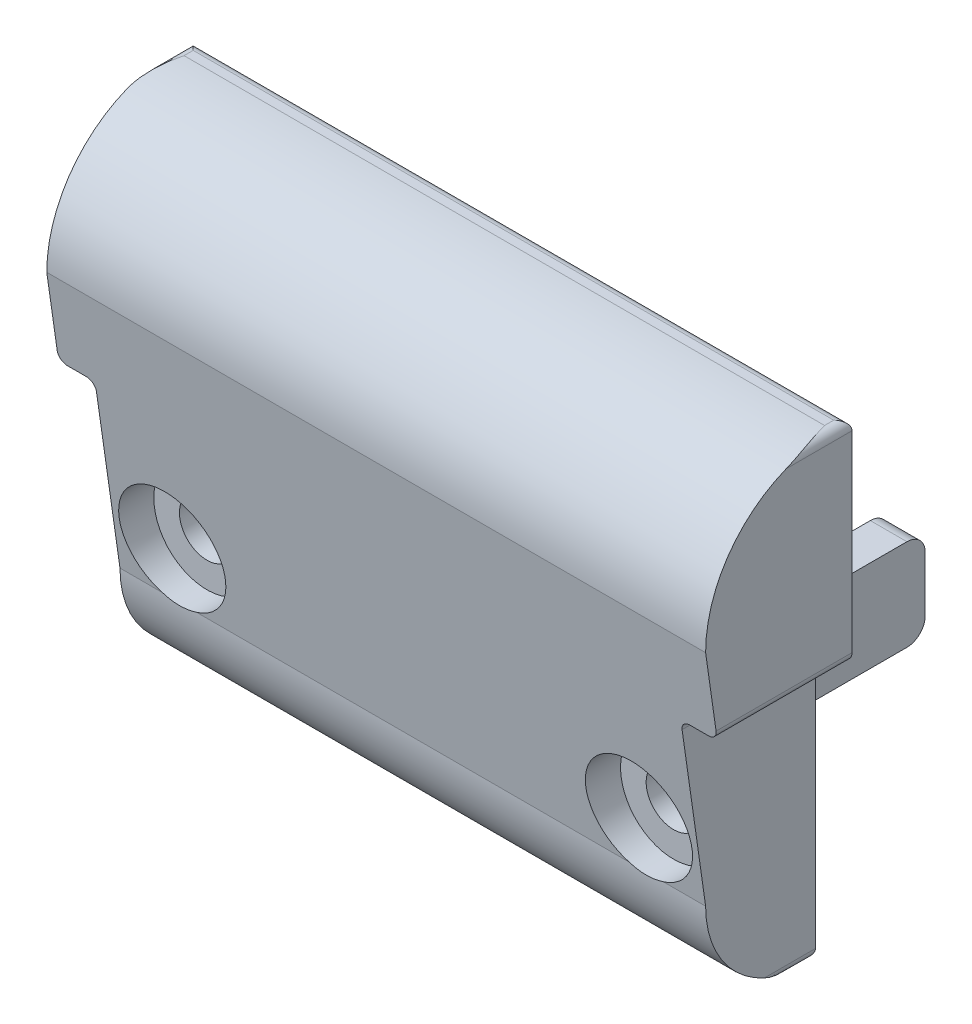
ISO-10303-21;
HEADER;
FILE_DESCRIPTION(('STEP AP214'),'2;1');
FILE_NAME('part.step','',(''),(''),'','','');
FILE_SCHEMA(('AUTOMOTIVE_DESIGN { 1 0 10303 214 1 1 1 1 }'));
ENDSEC;
DATA;
#1=APPLICATION_CONTEXT('core data for automotive mechanical design processes');
#2=APPLICATION_PROTOCOL_DEFINITION('international standard','automotive_design',2000,#1);
#3=PRODUCT_CONTEXT('',#1,'mechanical');
#4=PRODUCT('Part','Part','',(#3));
#5=PRODUCT_RELATED_PRODUCT_CATEGORY('part','',(#4));
#6=PRODUCT_DEFINITION_FORMATION('','',#4);
#7=PRODUCT_DEFINITION_CONTEXT('part definition',#1,'design');
#8=PRODUCT_DEFINITION('design','',#6,#7);
#9=PRODUCT_DEFINITION_SHAPE('','',#8);
#10=(LENGTH_UNIT() NAMED_UNIT(*) SI_UNIT(.MILLI.,.METRE.));
#11=(NAMED_UNIT(*) PLANE_ANGLE_UNIT() SI_UNIT($,.RADIAN.));
#12=(NAMED_UNIT(*) SI_UNIT($,.STERADIAN.) SOLID_ANGLE_UNIT());
#13=UNCERTAINTY_MEASURE_WITH_UNIT(LENGTH_MEASURE(1.E-05),#10,'distance_accuracy_value','');
#14=(GEOMETRIC_REPRESENTATION_CONTEXT(3) GLOBAL_UNCERTAINTY_ASSIGNED_CONTEXT((#13)) GLOBAL_UNIT_ASSIGNED_CONTEXT((#10,
#11,#12)) REPRESENTATION_CONTEXT('',''));
#15=CARTESIAN_POINT('',(0.,0.,0.));
#16=DIRECTION('',(0.,0.,1.));
#17=DIRECTION('',(1.,0.,0.));
#18=AXIS2_PLACEMENT_3D('',#15,#16,#17);
#19=CARTESIAN_POINT('',(-18.,-7.75,0.5));
#20=DIRECTION('',(-1.,0.,0.));
#21=DIRECTION('',(0.,0.,1.));
#22=AXIS2_PLACEMENT_3D('',#19,#20,#21);
#23=CYLINDRICAL_SURFACE('',#22,5.5);
#24=CARTESIAN_POINT('',(-15.4628480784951,-3.97508278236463,4.5));
#25=CARTESIAN_POINT('',(-15.4894617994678,-4.04553324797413,4.56649686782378));
#26=CARTESIAN_POINT('',(-15.5137951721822,-4.11823937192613,4.63158129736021));
#27=CARTESIAN_POINT('',(-15.5571963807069,-4.2680527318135,4.75860105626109));
#28=CARTESIAN_POINT('',(-15.5762557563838,-4.34516680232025,4.8205311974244));
#29=CARTESIAN_POINT('',(-15.6084190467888,-4.50397587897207,4.94109520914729));
#30=CARTESIAN_POINT('',(-15.621483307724,-4.58569748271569,4.99970494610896));
#31=CARTESIAN_POINT('',(-15.6406628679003,-4.75273510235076,5.11265407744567));
#32=CARTESIAN_POINT('',(-15.6467827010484,-4.83804873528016,5.1669962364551));
#33=CARTESIAN_POINT('',(-15.6526433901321,-5.06480654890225,5.30272980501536));
#34=CARTESIAN_POINT('',(-15.6462166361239,-5.20874777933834,5.38040268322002));
#35=CARTESIAN_POINT('',(-15.6102879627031,-5.50023396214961,5.52142261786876));
#36=CARTESIAN_POINT('',(-15.5808584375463,-5.64776620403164,5.58481381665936));
#37=CARTESIAN_POINT('',(-15.4969024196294,-5.94238606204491,5.69687336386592));
#38=CARTESIAN_POINT('',(-15.4422373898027,-6.0894666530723,5.74545795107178));
#39=CARTESIAN_POINT('',(-15.3075856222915,-6.37616882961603,5.82774553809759));
#40=CARTESIAN_POINT('',(-15.2275816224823,-6.51578525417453,5.86143835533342));
#41=CARTESIAN_POINT('',(-15.0512091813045,-6.77105366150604,5.91362633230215));
#42=CARTESIAN_POINT('',(-14.9565922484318,-6.88772453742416,5.9330978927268));
#43=CARTESIAN_POINT('',(-14.7497975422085,-7.10555543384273,5.96322234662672));
#44=CARTESIAN_POINT('',(-14.6376214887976,-7.20671697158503,5.97387610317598));
#45=CARTESIAN_POINT('',(-14.3961926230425,-7.39243162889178,5.98917418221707));
#46=CARTESIAN_POINT('',(-14.2666342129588,-7.47659731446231,5.99368945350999));
#47=CARTESIAN_POINT('',(-13.9957394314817,-7.6233332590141,5.99903288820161));
#48=CARTESIAN_POINT('',(-13.8544003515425,-7.68589853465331,5.99986020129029));
#49=CARTESIAN_POINT('',(-13.5569885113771,-7.79010734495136,6.00011397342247));
#50=CARTESIAN_POINT('',(-13.4005385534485,-7.83067743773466,5.99947542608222));
#51=CARTESIAN_POINT('',(-13.0830758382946,-7.88530915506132,5.99840390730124));
#52=CARTESIAN_POINT('',(-12.9220628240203,-7.89936928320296,5.9979709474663));
#53=CARTESIAN_POINT('',(-12.5979633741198,-7.90059646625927,5.99793832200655));
#54=CARTESIAN_POINT('',(-12.4348755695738,-7.88743389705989,5.99834886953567));
#55=CARTESIAN_POINT('',(-12.1132114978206,-7.83391749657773,5.99942379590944));
#56=CARTESIAN_POINT('',(-11.9546356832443,-7.79356094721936,6.00008820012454));
#57=CARTESIAN_POINT('',(-11.6464591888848,-7.68678204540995,5.99989423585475));
#58=CARTESIAN_POINT('',(-11.496861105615,-7.62035219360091,5.99903542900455));
#59=CARTESIAN_POINT('',(-11.2109968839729,-7.46334164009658,5.99308398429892));
#60=CARTESIAN_POINT('',(-11.0747299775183,-7.37276233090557,5.98799159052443));
#61=CARTESIAN_POINT('',(-10.82095163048,-7.1713428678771,5.97039638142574));
#62=CARTESIAN_POINT('',(-10.7032569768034,-7.06072725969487,5.95797255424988));
#63=CARTESIAN_POINT('',(-10.4885078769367,-6.82245570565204,5.92255605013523));
#64=CARTESIAN_POINT('',(-10.3914466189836,-6.69480540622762,5.89956686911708));
#65=CARTESIAN_POINT('',(-10.2245598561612,-6.43355802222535,5.841726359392));
#66=CARTESIAN_POINT('',(-10.153700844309,-6.30049123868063,5.80745873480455));
#67=CARTESIAN_POINT('',(-10.0345100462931,-6.0286494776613,5.72561543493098));
#68=CARTESIAN_POINT('',(-9.98615903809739,-5.88987948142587,5.67805117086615));
#69=CARTESIAN_POINT('',(-9.91238251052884,-5.61467069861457,5.57067507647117));
#70=CARTESIAN_POINT('',(-9.88649429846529,-5.4782445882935,5.5111431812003));
#71=CARTESIAN_POINT('',(-9.8543142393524,-5.20856970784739,5.37992569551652));
#72=CARTESIAN_POINT('',(-9.84807636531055,-5.07533068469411,5.3082072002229));
#73=CARTESIAN_POINT('',(-9.85217788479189,-4.85671473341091,5.17863195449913));
#74=CARTESIAN_POINT('',(-9.85789787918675,-4.76952925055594,5.12356606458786));
#75=CARTESIAN_POINT('',(-9.87659654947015,-4.59884942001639,5.00897026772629));
#76=CARTESIAN_POINT('',(-9.8895809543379,-4.51535804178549,4.94943686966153));
#77=CARTESIAN_POINT('',(-9.9218753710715,-4.35306298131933,4.82679014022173));
#78=CARTESIAN_POINT('',(-9.94115196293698,-4.2742370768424,4.76369714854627));
#79=CARTESIAN_POINT('',(-9.98521853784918,-4.12119000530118,4.63422185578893));
#80=CARTESIAN_POINT('',(-10.0099986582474,-4.04696090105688,4.56784560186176));
#81=CARTESIAN_POINT('',(-10.0371519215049,-3.97508278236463,4.5));
#82=B_SPLINE_CURVE_WITH_KNOTS('',3,(#24,#25,#26,#27,#28,#29,#30,#31,#32,#33,#34,#35,#36,#37,#38,
#39,#40,#41,#42,#43,#44,#45,#46,#47,#48,#49,#50,#51,#52,#53,#54,#55,#56,#57,#58,#59,#60,#61,#62,
#63,#64,#65,#66,#67,#68,#69,#70,#71,#72,#73,#74,#75,#76,#77,#78,#79,#80,#81),.UNSPECIFIED.,.F.,
.F.,(4,2,2,2,2,2,2,2,2,2,2,2,2,2,2,2,2,2,2,2,2,2,2,2,2,2,2,2,4),(0.,0.301399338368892,
0.603279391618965,0.907128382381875,1.21077888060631,1.69963960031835,2.18696794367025,
2.67700401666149,3.16737464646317,3.61969485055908,4.0719707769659,4.53361518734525,
4.99536603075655,5.4779872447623,5.96063570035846,6.4491624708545,6.93773807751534,
7.42645431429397,7.91514237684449,8.39865908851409,8.88201592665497,9.34350536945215,
9.80459996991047,10.2559546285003,10.7085479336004,11.017983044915,11.3276625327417,
11.6357232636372,11.9432363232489),.UNSPECIFIED.);
#83=CARTESIAN_POINT('',(-13.6705976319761,-7.75,6.));
#84=VERTEX_POINT('',#83);
#85=CARTESIAN_POINT('',(-11.8294023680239,-7.75,6.));
#86=VERTEX_POINT('',#85);
#87=EDGE_CURVE('E28',#84,#86,#82,.T.);
#88=ORIENTED_EDGE('',*,*,#87,.F.);
#89=DIRECTION('',(-1.,0.,0.));
#90=VECTOR('',#89,1.);
#91=CARTESIAN_POINT('',(-18.,-7.75,6.));
#92=LINE('',#91,#90);
#93=CARTESIAN_POINT('',(-16.,-7.75,6.));
#94=VERTEX_POINT('',#93);
#95=EDGE_CURVE('E256',#84,#94,#92,.T.);
#96=ORIENTED_EDGE('',*,*,#95,.T.);
#97=CARTESIAN_POINT('',(-16.,-7.75,0.5));
#98=DIRECTION('',(-1.,0.,0.));
#99=DIRECTION('',(0.,0.,1.));
#100=AXIS2_PLACEMENT_3D('',#97,#98,#99);
#101=CIRCLE('',#100,5.5);
#102=CARTESIAN_POINT('',(-16.,-12.75,2.79128784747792));
#103=VERTEX_POINT('',#102);
#104=EDGE_CURVE('E511',#94,#103,#101,.F.);
#105=ORIENTED_EDGE('',*,*,#104,.T.);
#106=CARTESIAN_POINT('',(-16.,-12.75,2.79128784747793));
#107=CARTESIAN_POINT('',(-15.9999928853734,-12.7676919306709,2.75268234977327));
#108=CARTESIAN_POINT('',(-15.9990619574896,-12.7849301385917,2.71388334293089));
#109=CARTESIAN_POINT('',(-15.9955775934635,-12.8184727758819,2.63597292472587));
#110=CARTESIAN_POINT('',(-15.9930248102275,-12.8347775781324,2.5968616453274));
#111=CARTESIAN_POINT('',(-15.9832822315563,-12.8822128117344,2.4792741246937));
#112=CARTESIAN_POINT('',(-15.9740064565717,-12.9119316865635,2.40039651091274));
#113=CARTESIAN_POINT('',(-15.9512404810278,-12.9674337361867,2.24223625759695));
#114=CARTESIAN_POINT('',(-15.9377660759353,-12.993231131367,2.16295621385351));
#115=CARTESIAN_POINT('',(-15.9075328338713,-13.0410625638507,2.00384917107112));
#116=CARTESIAN_POINT('',(-15.8907720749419,-13.0630943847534,1.92402187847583));
#117=CARTESIAN_POINT('',(-15.8479680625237,-13.110972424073,1.7340321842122));
#118=CARTESIAN_POINT('',(-15.8207989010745,-13.1351583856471,1.62370225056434));
#119=CARTESIAN_POINT('',(-15.7631917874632,-13.1766019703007,1.40258450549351));
#120=CARTESIAN_POINT('',(-15.7327521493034,-13.1938559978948,1.29179648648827));
#121=CARTESIAN_POINT('',(-15.6383560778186,-13.2353694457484,0.959004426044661));
#122=CARTESIAN_POINT('',(-15.571294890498,-13.2494079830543,0.736461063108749));
#123=CARTESIAN_POINT('',(-15.502854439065,-13.2499938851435,0.50946716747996));
#124=CARTESIAN_POINT('',(-15.5014271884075,-13.2499999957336,0.504733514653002));
#125=CARTESIAN_POINT('',(-15.5,-13.25,0.5));
#126=B_SPLINE_CURVE_WITH_KNOTS('',3,(#106,#107,#108,#109,#110,#111,#112,#113,#114,#115,#116,
#117,#118,#119,#120,#121,#122,#123,#124,#125),.UNSPECIFIED.,.F.,.F.,(4,2,2,2,2,2,2,2,2,4),(0.,
0.127365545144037,0.254679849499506,0.508822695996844,0.762020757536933,1.01536734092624,
1.36356786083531,1.71194875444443,2.40835877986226,2.42319118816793),.UNSPECIFIED.);
#127=CARTESIAN_POINT('',(-15.5,-13.25,0.5));
#128=VERTEX_POINT('',#127);
#129=EDGE_CURVE('E307',#103,#128,#126,.T.);
#130=ORIENTED_EDGE('',*,*,#129,.T.);
#131=DIRECTION('',(-1.,0.,0.));
#132=VECTOR('',#131,1.);
#133=CARTESIAN_POINT('',(-36.,-13.25,0.5));
#134=LINE('',#133,#132);
#135=CARTESIAN_POINT('',(15.5,-13.25,0.5));
#136=VERTEX_POINT('',#135);
#137=EDGE_CURVE('E581',#136,#128,#134,.T.);
#138=ORIENTED_EDGE('',*,*,#137,.F.);
#139=CARTESIAN_POINT('',(15.5,-13.25,0.5));
#140=CARTESIAN_POINT('',(15.500000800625,-13.25,0.499999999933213));
#141=CARTESIAN_POINT('',(15.5000016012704,-13.249999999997,0.500000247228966));
#142=CARTESIAN_POINT('',(15.5000031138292,-13.2499999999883,0.500000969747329));
#143=CARTESIAN_POINT('',(15.5000038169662,-13.2499999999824,0.500001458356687));
#144=CARTESIAN_POINT('',(15.5000052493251,-13.2499999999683,0.50000262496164));
#145=CARTESIAN_POINT('',(15.5000059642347,-13.2499999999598,0.500003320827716));
#146=CARTESIAN_POINT('',(15.5000072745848,-13.2499999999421,0.500004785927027));
#147=CARTESIAN_POINT('',(15.500007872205,-13.2499999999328,0.500005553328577));
#148=CARTESIAN_POINT('',(15.5000100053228,-13.2499999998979,0.500008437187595));
#149=CARTESIAN_POINT('',(15.5000114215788,-13.2499999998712,0.500010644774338));
#150=CARTESIAN_POINT('',(15.5000138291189,-13.2499999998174,0.500015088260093));
#151=CARTESIAN_POINT('',(15.5000148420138,-13.2499999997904,0.500017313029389));
#152=CARTESIAN_POINT('',(15.5000189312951,-13.2499999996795,0.500026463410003));
#153=CARTESIAN_POINT('',(15.5000218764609,-13.2499999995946,0.500033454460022));
#154=CARTESIAN_POINT('',(15.5000263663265,-13.2499999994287,0.500046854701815));
#155=CARTESIAN_POINT('',(15.5000280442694,-13.2499999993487,0.500053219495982));
#156=CARTESIAN_POINT('',(15.5000400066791,-13.2499999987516,0.500099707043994));
#157=CARTESIAN_POINT('',(15.5000488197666,-13.2499999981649,0.500140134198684));
#158=CARTESIAN_POINT('',(15.5000873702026,-13.2499999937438,0.500298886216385));
#159=CARTESIAN_POINT('',(15.5001243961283,-13.2499999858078,0.500415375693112));
#160=CARTESIAN_POINT('',(15.5002675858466,-13.2499999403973,0.500874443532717));
#161=CARTESIAN_POINT('',(15.5003688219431,-13.2499998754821,0.501218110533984));
#162=CARTESIAN_POINT('',(15.5007722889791,-13.2499994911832,0.502576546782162));
#163=CARTESIAN_POINT('',(15.5010805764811,-13.2499989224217,0.503589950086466));
#164=CARTESIAN_POINT('',(15.5023580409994,-13.2499953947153,0.507801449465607));
#165=CARTESIAN_POINT('',(15.5033197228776,-13.2499899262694,0.511001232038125));
#166=CARTESIAN_POINT('',(15.5176213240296,-13.2498671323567,0.55857047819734));
#167=CARTESIAN_POINT('',(15.5310199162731,-13.2492158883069,0.602927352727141));
#168=CARTESIAN_POINT('',(15.5571861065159,-13.2468864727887,0.689879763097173));
#169=CARTESIAN_POINT('',(15.5699576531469,-13.2452500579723,0.732475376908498));
#170=CARTESIAN_POINT('',(15.5969873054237,-13.2407174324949,0.822994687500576));
#171=CARTESIAN_POINT('',(15.6112308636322,-13.2376889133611,0.870916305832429));
#172=CARTESIAN_POINT('',(15.6396398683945,-13.2303316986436,0.967250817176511));
#173=CARTESIAN_POINT('',(15.6538027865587,-13.2259892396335,1.01566339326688));
#174=CARTESIAN_POINT('',(15.6879027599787,-13.2138400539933,1.13350277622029));
#175=CARTESIAN_POINT('',(15.7076714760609,-13.205348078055,1.20290954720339));
#176=CARTESIAN_POINT('',(15.745778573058,-13.1859337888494,1.33980964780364));
#177=CARTESIAN_POINT('',(15.7641406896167,-13.1750797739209,1.4073061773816));
#178=CARTESIAN_POINT('',(15.8120031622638,-13.1424045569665,1.5887581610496));
#179=CARTESIAN_POINT('',(15.8404307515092,-13.118188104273,1.70258273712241));
#180=CARTESIAN_POINT('',(15.8926065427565,-13.0620004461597,1.93058529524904));
#181=CARTESIAN_POINT('',(15.9163081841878,-13.0299583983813,2.04475652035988));
#182=CARTESIAN_POINT('',(15.9579604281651,-12.9554940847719,2.28020297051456));
#183=CARTESIAN_POINT('',(15.9753751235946,-12.9124912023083,2.40139887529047));
#184=CARTESIAN_POINT('',(15.9921604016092,-12.8414448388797,2.58118469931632));
#185=CARTESIAN_POINT('',(15.9962004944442,-12.8167255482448,2.64066743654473));
#186=CARTESIAN_POINT('',(16.0004412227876,-12.7651602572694,2.75883010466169));
#187=CARTESIAN_POINT('',(16.0006443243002,-12.7383156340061,2.81751052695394));
#188=CARTESIAN_POINT('',(15.997022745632,-12.6926718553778,2.91281955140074));
#189=CARTESIAN_POINT('',(15.994621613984,-12.6744550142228,2.94978250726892));
#190=CARTESIAN_POINT('',(15.9874956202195,-12.637274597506,3.02314037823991));
#191=CARTESIAN_POINT('',(15.9827694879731,-12.6183106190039,3.05953497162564));
#192=CARTESIAN_POINT('',(15.9706504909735,-12.5800431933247,3.1310270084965));
#193=CARTESIAN_POINT('',(15.9632965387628,-12.560748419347,3.16613554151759));
#194=CARTESIAN_POINT('',(15.9453887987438,-12.521769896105,3.23528489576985));
#195=CARTESIAN_POINT('',(15.9348380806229,-12.5020865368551,3.269326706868));
#196=CARTESIAN_POINT('',(15.9117695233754,-12.4656836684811,3.33079495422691));
#197=CARTESIAN_POINT('',(15.8998051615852,-12.4489747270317,3.35843258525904));
#198=CARTESIAN_POINT('',(15.8724944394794,-12.4157667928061,3.41232267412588));
#199=CARTESIAN_POINT('',(15.8571360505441,-12.3992687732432,3.4385697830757));
#200=CARTESIAN_POINT('',(15.8221938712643,-12.3668981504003,3.48917436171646));
#201=CARTESIAN_POINT('',(15.8025614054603,-12.3510354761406,3.51350525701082));
#202=CARTESIAN_POINT('',(15.7584510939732,-12.3211571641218,3.55863458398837));
#203=CARTESIAN_POINT('',(15.7339971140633,-12.3071329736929,3.5794495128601));
#204=CARTESIAN_POINT('',(15.6920599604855,-12.288070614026,3.60742063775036));
#205=CARTESIAN_POINT('',(15.6764091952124,-12.2818328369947,3.61650237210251));
#206=CARTESIAN_POINT('',(15.643587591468,-12.2707485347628,3.63255919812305));
#207=CARTESIAN_POINT('',(15.6264175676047,-12.2659012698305,3.63953541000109));
#208=CARTESIAN_POINT('',(15.5906552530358,-12.2579433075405,3.65095177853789));
#209=CARTESIAN_POINT('',(15.5720506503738,-12.25485013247,3.65536635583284));
#210=CARTESIAN_POINT('',(15.5341468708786,-12.2508048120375,3.66113418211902));
#211=CARTESIAN_POINT('',(15.5148484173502,-12.2498504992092,3.66249053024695));
#212=CARTESIAN_POINT('',(15.4787386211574,-12.250167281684,3.6620395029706));
#213=CARTESIAN_POINT('',(15.4619185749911,-12.2511745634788,3.66060718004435));
#214=CARTESIAN_POINT('',(15.4288238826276,-12.2548119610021,3.65542058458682));
#215=CARTESIAN_POINT('',(15.4125493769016,-12.2574424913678,3.65166571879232));
#216=CARTESIAN_POINT('',(15.3810571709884,-12.2640884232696,3.64213916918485));
#217=CARTESIAN_POINT('',(15.3658322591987,-12.2680929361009,3.6363833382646));
#218=CARTESIAN_POINT('',(15.3365125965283,-12.2772336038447,3.62317477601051));
#219=CARTESIAN_POINT('',(15.3224182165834,-12.2823701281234,3.61572149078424));
#220=CARTESIAN_POINT('',(15.2870009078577,-12.2970159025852,3.59433366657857));
#221=CARTESIAN_POINT('',(15.2666657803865,-12.3072516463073,3.57925979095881));
#222=CARTESIAN_POINT('',(15.229080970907,-12.3291925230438,3.54653713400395));
#223=CARTESIAN_POINT('',(15.2118413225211,-12.3409022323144,3.52888030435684));
#224=CARTESIAN_POINT('',(15.170162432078,-12.3728145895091,3.48008031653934));
#225=CARTESIAN_POINT('',(15.1480255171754,-12.3937220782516,3.44744614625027));
#226=CARTESIAN_POINT('',(15.1096702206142,-12.4362149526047,3.37941192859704));
#227=CARTESIAN_POINT('',(15.093455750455,-12.4578007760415,3.34401007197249));
#228=CARTESIAN_POINT('',(15.066755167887,-12.4992827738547,3.27413737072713));
#229=CARTESIAN_POINT('',(15.0559305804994,-12.5191842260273,3.23979590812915));
#230=CARTESIAN_POINT('',(15.0375734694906,-12.5586012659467,3.17001232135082));
#231=CARTESIAN_POINT('',(15.0300439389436,-12.5781164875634,3.13456922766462));
#232=CARTESIAN_POINT('',(15.0114195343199,-12.6361543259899,3.02630711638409));
#233=CARTESIAN_POINT('',(15.0045299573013,-12.6737463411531,2.95226401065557));
#234=CARTESIAN_POINT('',(14.9986829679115,-12.7461559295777,2.80121277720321));
#235=CARTESIAN_POINT('',(14.9998536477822,-12.7809197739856,2.72417620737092));
#236=CARTESIAN_POINT('',(15.0083384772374,-12.8468187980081,2.56871459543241));
#237=CARTESIAN_POINT('',(15.0156670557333,-12.8779452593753,2.49028671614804));
#238=CARTESIAN_POINT('',(15.0345466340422,-12.9349577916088,2.33646739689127));
#239=CARTESIAN_POINT('',(15.0458742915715,-12.9610253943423,2.26111439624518));
#240=CARTESIAN_POINT('',(15.0717765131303,-13.0095698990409,2.11032956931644));
#241=CARTESIAN_POINT('',(15.0863315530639,-13.0320670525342,2.03490082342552));
#242=CARTESIAN_POINT('',(15.1235716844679,-13.0809840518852,1.85714029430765));
#243=CARTESIAN_POINT('',(15.1473182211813,-13.106014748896,1.75464603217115));
#244=CARTESIAN_POINT('',(15.1857300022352,-13.1392677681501,1.59940026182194));
#245=CARTESIAN_POINT('',(15.1991659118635,-13.1497284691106,1.54680377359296));
#246=CARTESIAN_POINT('',(15.2268021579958,-13.1691044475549,1.44137487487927));
#247=CARTESIAN_POINT('',(15.2410043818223,-13.1780156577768,1.38854220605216));
#248=CARTESIAN_POINT('',(15.2753042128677,-13.1972441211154,1.26345894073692));
#249=CARTESIAN_POINT('',(15.2956581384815,-13.2068835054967,1.19117400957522));
#250=CARTESIAN_POINT('',(15.3369343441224,-13.223176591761,1.047287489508));
#251=CARTESIAN_POINT('',(15.3578480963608,-13.2298614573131,0.975686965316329));
#252=CARTESIAN_POINT('',(15.3977849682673,-13.2398243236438,0.840437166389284));
#253=CARTESIAN_POINT('',(15.4167578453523,-13.24339979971,0.776794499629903));
#254=CARTESIAN_POINT('',(15.4557490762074,-13.2484399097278,0.646840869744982));
#255=CARTESIAN_POINT('',(15.4757780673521,-13.2498104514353,0.580529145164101));
#256=CARTESIAN_POINT('',(15.4966808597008,-13.2499899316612,0.510999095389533));
#257=CARTESIAN_POINT('',(15.4976432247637,-13.2499954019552,0.507797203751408));
#258=CARTESIAN_POINT('',(15.4989208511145,-13.2499989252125,0.503585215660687));
#259=CARTESIAN_POINT('',(15.4992286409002,-13.2499994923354,0.502573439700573));
#260=CARTESIAN_POINT('',(15.4996315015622,-13.2499998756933,0.501217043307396));
#261=CARTESIAN_POINT('',(15.4997326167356,-13.2499999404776,0.500873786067));
#262=CARTESIAN_POINT('',(15.4998756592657,-13.2499999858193,0.500415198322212));
#263=CARTESIAN_POINT('',(15.4999126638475,-13.2499999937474,0.500298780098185));
#264=CARTESIAN_POINT('',(15.4999511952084,-13.2499999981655,0.500140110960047));
#265=CARTESIAN_POINT('',(15.4999600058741,-13.2499999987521,0.500099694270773));
#266=CARTESIAN_POINT('',(15.4999719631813,-13.2499999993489,0.500053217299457));
#267=CARTESIAN_POINT('',(15.49997364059,-13.2499999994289,0.500046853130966));
#268=CARTESIAN_POINT('',(15.4999781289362,-13.2499999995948,0.500033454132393));
#269=CARTESIAN_POINT('',(15.4999810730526,-13.2499999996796,0.500026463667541));
#270=CARTESIAN_POINT('',(15.4999851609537,-13.2499999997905,0.500017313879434));
#271=CARTESIAN_POINT('',(15.4999861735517,-13.2499999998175,0.500015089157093));
#272=CARTESIAN_POINT('',(15.4999885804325,-13.2499999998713,0.500010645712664));
#273=CARTESIAN_POINT('',(15.4999899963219,-13.249999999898,0.500008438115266));
#274=CARTESIAN_POINT('',(15.4999921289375,-13.2499999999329,0.500005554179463));
#275=CARTESIAN_POINT('',(15.4999927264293,-13.2499999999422,0.500004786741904));
#276=CARTESIAN_POINT('',(15.4999940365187,-13.2499999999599,0.500003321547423));
#277=CARTESIAN_POINT('',(15.4999947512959,-13.2499999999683,0.500002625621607));
#278=CARTESIAN_POINT('',(15.4999961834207,-13.2499999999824,0.500001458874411));
#279=CARTESIAN_POINT('',(15.4999968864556,-13.2499999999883,0.500000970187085));
#280=CARTESIAN_POINT('',(15.4999983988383,-13.249999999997,0.500000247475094));
#281=CARTESIAN_POINT('',(15.499999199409,-13.25,0.500000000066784));
#282=CARTESIAN_POINT('',(15.5,-13.25,0.5));
#283=B_SPLINE_CURVE_WITH_KNOTS('',3,(#139,#140,#141,#142,#143,#144,#145,#146,#147,#148,#149,
#150,#151,#152,#153,#154,#155,#156,#157,#158,#159,#160,#161,#162,#163,#164,#165,#166,#167,#168,
#169,#170,#171,#172,#173,#174,#175,#176,#177,#178,#179,#180,#181,#182,#183,#184,#185,#186,#187,
#188,#189,#190,#191,#192,#193,#194,#195,#196,#197,#198,#199,#200,#201,#202,#203,#204,#205,#206,
#207,#208,#209,#210,#211,#212,#213,#214,#215,#216,#217,#218,#219,#220,#221,#222,#223,#224,#225,
#226,#227,#228,#229,#230,#231,#232,#233,#234,#235,#236,#237,#238,#239,#240,#241,#242,#243,#244,
#245,#246,#247,#248,#249,#250,#251,#252,#253,#254,#255,#256,#257,#258,#259,#260,#261,#262,#263,
#264,#265,#266,#267,#268,#269,#270,#271,#272,#273,#274,#275,#276,#277,#278,#279,#280,#281,#282),
.UNSPECIFIED.,.T.,.F.,(4,2,2,2,2,2,2,2,2,2,2,2,2,2,2,2,2,2,2,2,2,2,2,2,2,2,2,2,2,2,2,2,2,2,2,2,
2,2,2,2,2,2,2,2,2,2,2,2,2,2,2,2,2,2,2,2,2,2,2,2,2,2,2,2,2,2,2,2,2,2,2,4),(0.,
2.40967791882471E-06,4.97127419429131E-06,7.94892544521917E-06,1.08645080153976E-05,
1.87003870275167E-05,2.60278699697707E-05,4.87353255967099E-05,6.8456371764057E-05,
0.000192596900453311,0.000558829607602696,0.0016340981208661,0.00481130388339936,
0.0148354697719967,0.153837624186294,0.287326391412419,0.437564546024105,0.589434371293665,
0.80737013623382,1.01968748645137,1.37874189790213,1.74117572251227,2.12966375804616,
2.32317333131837,2.51655853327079,2.64033158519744,2.76417232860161,2.88625046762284,
3.00821175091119,3.11138351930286,3.21492697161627,3.31971783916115,3.42400247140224,
3.4812389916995,3.53844500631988,3.59621283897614,3.65392210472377,3.7044017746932,
3.75489434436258,3.80499566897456,3.85511336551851,3.93655475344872,4.01825553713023,
4.15140335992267,4.2846389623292,4.40787968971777,4.53123213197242,4.78049003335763,
5.03371813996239,5.28754125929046,5.52898626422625,5.76900866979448,6.09316443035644,
6.25899635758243,6.42525721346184,6.65232957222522,6.87694606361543,7.07643356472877,
7.2842275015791,7.29425831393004,7.29743041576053,7.29850440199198,7.29887041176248,
7.298994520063,7.29901423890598,7.29903694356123,7.29904427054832,7.29905210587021,
7.29905502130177,7.29905799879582,7.29906056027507,7.29906296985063),.UNSPECIFIED.);
#284=CARTESIAN_POINT('',(16.,-12.75,2.79128784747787));
#285=VERTEX_POINT('',#284);
#286=EDGE_CURVE('E298',#136,#285,#283,.T.);
#287=ORIENTED_EDGE('',*,*,#286,.T.);
#288=CARTESIAN_POINT('',(16.,-7.75,0.5));
#289=DIRECTION('',(-1.,0.,0.));
#290=DIRECTION('',(0.,0.,1.));
#291=AXIS2_PLACEMENT_3D('',#288,#289,#290);
#292=CIRCLE('',#291,5.5);
#293=CARTESIAN_POINT('',(16.,-7.75,6.));
#294=VERTEX_POINT('',#293);
#295=EDGE_CURVE('E588',#285,#294,#292,.T.);
#296=ORIENTED_EDGE('',*,*,#295,.T.);
#297=CARTESIAN_POINT('',(13.6705976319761,-7.75,6.));
#298=VERTEX_POINT('',#297);
#299=EDGE_CURVE('E269',#294,#298,#92,.T.);
#300=ORIENTED_EDGE('',*,*,#299,.T.);
#301=CARTESIAN_POINT('',(10.0371519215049,-3.97508278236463,4.5));
#302=CARTESIAN_POINT('',(10.0105382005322,-4.04553324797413,4.56649686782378));
#303=CARTESIAN_POINT('',(9.98620482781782,-4.11823937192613,4.63158129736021));
#304=CARTESIAN_POINT('',(9.94280361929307,-4.2680527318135,4.75860105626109));
#305=CARTESIAN_POINT('',(9.92374424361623,-4.34516680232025,4.82053119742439));
#306=CARTESIAN_POINT('',(9.89158095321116,-4.50397587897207,4.94109520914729));
#307=CARTESIAN_POINT('',(9.87851669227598,-4.58569748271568,4.99970494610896));
#308=CARTESIAN_POINT('',(9.85933713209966,-4.75273510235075,5.11265407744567));
#309=CARTESIAN_POINT('',(9.85321729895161,-4.83804873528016,5.1669962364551));
#310=CARTESIAN_POINT('',(9.84735660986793,-5.06480654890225,5.30272980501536));
#311=CARTESIAN_POINT('',(9.85378336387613,-5.20874777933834,5.38040268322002));
#312=CARTESIAN_POINT('',(9.88971203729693,-5.50023396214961,5.52142261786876));
#313=CARTESIAN_POINT('',(9.91914156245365,-5.64776620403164,5.58481381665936));
#314=CARTESIAN_POINT('',(10.0030975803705,-5.94238606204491,5.69687336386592));
#315=CARTESIAN_POINT('',(10.0577626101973,-6.0894666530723,5.74545795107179));
#316=CARTESIAN_POINT('',(10.1924143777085,-6.37616882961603,5.82774553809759));
#317=CARTESIAN_POINT('',(10.2724183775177,-6.51578525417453,5.86143835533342));
#318=CARTESIAN_POINT('',(10.4487908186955,-6.77105366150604,5.91362633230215));
#319=CARTESIAN_POINT('',(10.5434077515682,-6.88772453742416,5.9330978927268));
#320=CARTESIAN_POINT('',(10.7502024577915,-7.10555543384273,5.96322234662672));
#321=CARTESIAN_POINT('',(10.8623785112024,-7.20671697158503,5.97387610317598));
#322=CARTESIAN_POINT('',(11.1038073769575,-7.39243162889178,5.98917418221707));
#323=CARTESIAN_POINT('',(11.2333657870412,-7.47659731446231,5.99368945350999));
#324=CARTESIAN_POINT('',(11.5042605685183,-7.62333325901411,5.99903288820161));
#325=CARTESIAN_POINT('',(11.6455996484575,-7.68589853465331,5.99986020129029));
#326=CARTESIAN_POINT('',(11.9430114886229,-7.79010734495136,6.00011397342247));
#327=CARTESIAN_POINT('',(12.0994614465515,-7.83067743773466,5.99947542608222));
#328=CARTESIAN_POINT('',(12.4169241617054,-7.88530915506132,5.99840390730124));
#329=CARTESIAN_POINT('',(12.5779371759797,-7.89936928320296,5.9979709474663));
#330=CARTESIAN_POINT('',(12.9020366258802,-7.90059646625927,5.99793832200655));
#331=CARTESIAN_POINT('',(13.0651244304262,-7.88743389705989,5.99834886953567));
#332=CARTESIAN_POINT('',(13.3867885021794,-7.83391749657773,5.99942379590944));
#333=CARTESIAN_POINT('',(13.5453643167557,-7.79356094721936,6.00008820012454));
#334=CARTESIAN_POINT('',(13.8535408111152,-7.68678204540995,5.99989423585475));
#335=CARTESIAN_POINT('',(14.003138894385,-7.62035219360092,5.99903542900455));
#336=CARTESIAN_POINT('',(14.2890031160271,-7.46334164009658,5.99308398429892));
#337=CARTESIAN_POINT('',(14.4252700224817,-7.37276233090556,5.98799159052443));
#338=CARTESIAN_POINT('',(14.67904836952,-7.1713428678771,5.97039638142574));
#339=CARTESIAN_POINT('',(14.7967430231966,-7.06072725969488,5.95797255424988));
#340=CARTESIAN_POINT('',(15.0114921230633,-6.82245570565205,5.92255605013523));
#341=CARTESIAN_POINT('',(15.1085533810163,-6.69480540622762,5.89956686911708));
#342=CARTESIAN_POINT('',(15.2754401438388,-6.43355802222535,5.841726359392));
#343=CARTESIAN_POINT('',(15.346299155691,-6.30049123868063,5.80745873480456));
#344=CARTESIAN_POINT('',(15.4654899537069,-6.0286494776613,5.72561543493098));
#345=CARTESIAN_POINT('',(15.5138409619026,-5.88987948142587,5.67805117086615));
#346=CARTESIAN_POINT('',(15.5876174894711,-5.61467069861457,5.57067507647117));
#347=CARTESIAN_POINT('',(15.6135057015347,-5.4782445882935,5.5111431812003));
#348=CARTESIAN_POINT('',(15.6456857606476,-5.20856970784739,5.37992569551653));
#349=CARTESIAN_POINT('',(15.6519236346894,-5.07533068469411,5.3082072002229));
#350=CARTESIAN_POINT('',(15.6478221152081,-4.85671473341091,5.17863195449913));
#351=CARTESIAN_POINT('',(15.6421021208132,-4.76952925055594,5.12356606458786));
#352=CARTESIAN_POINT('',(15.6234034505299,-4.59884942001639,5.00897026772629));
#353=CARTESIAN_POINT('',(15.6104190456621,-4.51535804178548,4.94943686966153));
#354=CARTESIAN_POINT('',(15.5781246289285,-4.35306298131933,4.82679014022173));
#355=CARTESIAN_POINT('',(15.558848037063,-4.2742370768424,4.76369714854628));
#356=CARTESIAN_POINT('',(15.5147814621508,-4.12119000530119,4.63422185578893));
#357=CARTESIAN_POINT('',(15.4900013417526,-4.04696090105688,4.56784560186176));
#358=CARTESIAN_POINT('',(15.4628480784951,-3.97508278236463,4.5));
#359=B_SPLINE_CURVE_WITH_KNOTS('',3,(#301,#302,#303,#304,#305,#306,#307,#308,#309,#310,#311,
#312,#313,#314,#315,#316,#317,#318,#319,#320,#321,#322,#323,#324,#325,#326,#327,#328,#329,#330,
#331,#332,#333,#334,#335,#336,#337,#338,#339,#340,#341,#342,#343,#344,#345,#346,#347,#348,#349,
#350,#351,#352,#353,#354,#355,#356,#357,#358),.UNSPECIFIED.,.F.,.F.,(4,2,2,2,2,2,2,2,2,2,2,2,2,
2,2,2,2,2,2,2,2,2,2,2,2,2,2,2,4),(0.,0.301399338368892,0.603279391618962,0.907128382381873,
1.21077888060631,1.69963960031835,2.18696794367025,2.67700401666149,3.16737464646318,
3.61969485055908,4.0719707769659,4.53361518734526,4.99536603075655,5.4779872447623,
5.96063570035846,6.4491624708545,6.93773807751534,7.42645431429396,7.91514237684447,
8.39865908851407,8.88201592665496,9.34350536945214,9.80459996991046,10.2559546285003,
10.7085479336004,11.017983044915,11.3276625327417,11.6357232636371,11.9432363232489),.UNSPECIFIED.);
#360=CARTESIAN_POINT('',(11.8294023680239,-7.75,6.));
#361=VERTEX_POINT('',#360);
#362=EDGE_CURVE('E34',#361,#298,#359,.T.);
#363=ORIENTED_EDGE('',*,*,#362,.F.);
#364=EDGE_CURVE('E258',#361,#86,#92,.T.);
#365=ORIENTED_EDGE('',*,*,#364,.T.);
#366=EDGE_LOOP('',(#88,#96,#105,#130,#138,#287,#296,#300,#363,#365));
#367=FACE_BOUND('',#366,.T.);
#368=ADVANCED_FACE('F14',(#367),#23,.T.);
#369=CARTESIAN_POINT('',(-18.,-7.75,6.));
#370=DIRECTION('',(0.,0.14142135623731,-0.989949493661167));
#371=DIRECTION('',(0.,-0.989949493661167,-0.14142135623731));
#372=AXIS2_PLACEMENT_3D('',#369,#370,#371);
#373=PLANE('',#372);
#374=ORIENTED_EDGE('',*,*,#95,.F.);
#375=CARTESIAN_POINT('',(-12.75,-5.,6.39285714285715));
#376=DIRECTION('',(0.,0.14142135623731,-0.989949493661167));
#377=DIRECTION('',(0.,-0.989949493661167,-0.14142135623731));
#378=AXIS2_PLACEMENT_3D('',#375,#376,#377);
#379=ELLIPSE('',#378,2.92944237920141,2.9);
#380=EDGE_CURVE('E9',#84,#86,#379,.T.);
#381=ORIENTED_EDGE('',*,*,#380,.T.);
#382=ORIENTED_EDGE('',*,*,#364,.F.);
#383=CARTESIAN_POINT('',(12.75,-5.,6.39285714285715));
#384=DIRECTION('',(0.,0.14142135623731,-0.989949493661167));
#385=DIRECTION('',(0.,-0.989949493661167,-0.14142135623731));
#386=AXIS2_PLACEMENT_3D('',#383,#384,#385);
#387=ELLIPSE('',#386,2.92944237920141,2.9);
#388=EDGE_CURVE('E22',#361,#298,#387,.T.);
#389=ORIENTED_EDGE('',*,*,#388,.T.);
#390=ORIENTED_EDGE('',*,*,#299,.F.);
#391=DIRECTION('',(0.,0.989949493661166,0.14142135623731));
#392=VECTOR('',#391,1.);
#393=CARTESIAN_POINT('',(16.,-7.75,6.));
#394=LINE('',#393,#392);
#395=CARTESIAN_POINT('',(16.,1.25,7.28571428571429));
#396=VERTEX_POINT('',#395);
#397=EDGE_CURVE('E585',#294,#396,#394,.T.);
#398=ORIENTED_EDGE('',*,*,#397,.T.);
#399=CARTESIAN_POINT('',(16.5,1.25,7.28571428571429));
#400=DIRECTION('',(0.,0.14142135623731,-0.989949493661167));
#401=DIRECTION('',(0.,-0.989949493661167,-0.14142135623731));
#402=AXIS2_PLACEMENT_3D('',#399,#400,#401);
#403=ELLIPSE('',#402,0.50507627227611,0.5);
#404=CARTESIAN_POINT('',(16.5,1.75,7.35714285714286));
#405=VERTEX_POINT('',#404);
#406=EDGE_CURVE('E267',#405,#396,#403,.F.);
#407=ORIENTED_EDGE('',*,*,#406,.F.);
#408=DIRECTION('',(-1.,0.,0.));
#409=VECTOR('',#408,1.);
#410=CARTESIAN_POINT('',(17.5,1.75,7.35714285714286));
#411=LINE('',#410,#409);
#412=CARTESIAN_POINT('',(17.5,1.75,7.35714285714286));
#413=VERTEX_POINT('',#412);
#414=EDGE_CURVE('E745',#405,#413,#411,.F.);
#415=ORIENTED_EDGE('',*,*,#414,.T.);
#416=CARTESIAN_POINT('',(17.5,2.25,7.42857142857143));
#417=DIRECTION('',(0.,0.14142135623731,-0.989949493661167));
#418=DIRECTION('',(0.,-0.989949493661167,-0.14142135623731));
#419=AXIS2_PLACEMENT_3D('',#416,#417,#418);
#420=ELLIPSE('',#419,0.50507627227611,0.5);
#421=CARTESIAN_POINT('',(18.,2.25,7.42857142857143));
#422=VERTEX_POINT('',#421);
#423=EDGE_CURVE('E270',#422,#413,#420,.T.);
#424=ORIENTED_EDGE('',*,*,#423,.F.);
#425=DIRECTION('',(0.,0.989949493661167,0.141421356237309));
#426=VECTOR('',#425,1.);
#427=CARTESIAN_POINT('',(18.,2.25,7.42857142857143));
#428=LINE('',#427,#426);
#429=CARTESIAN_POINT('',(18.,6.25,8.));
#430=VERTEX_POINT('',#429);
#431=EDGE_CURVE('E561',#422,#430,#428,.T.);
#432=ORIENTED_EDGE('',*,*,#431,.T.);
#433=DIRECTION('',(-1.,0.,0.));
#434=VECTOR('',#433,1.);
#435=CARTESIAN_POINT('',(-18.,6.25,8.));
#436=LINE('',#435,#434);
#437=CARTESIAN_POINT('',(-18.,6.25,8.));
#438=VERTEX_POINT('',#437);
#439=EDGE_CURVE('E282',#438,#430,#436,.F.);
#440=ORIENTED_EDGE('',*,*,#439,.F.);
#441=DIRECTION('',(0.,-0.989949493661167,-0.141421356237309));
#442=VECTOR('',#441,1.);
#443=CARTESIAN_POINT('',(-18.,6.25,8.));
#444=LINE('',#443,#442);
#445=CARTESIAN_POINT('',(-18.,2.25,7.42857142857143));
#446=VERTEX_POINT('',#445);
#447=EDGE_CURVE('E569',#438,#446,#444,.T.);
#448=ORIENTED_EDGE('',*,*,#447,.T.);
#449=CARTESIAN_POINT('',(-17.5,2.25,7.42857142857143));
#450=DIRECTION('',(0.,0.14142135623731,-0.989949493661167));
#451=DIRECTION('',(0.,-0.989949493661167,-0.14142135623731));
#452=AXIS2_PLACEMENT_3D('',#449,#450,#451);
#453=ELLIPSE('',#452,0.505076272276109,0.5);
#454=CARTESIAN_POINT('',(-17.5,1.75,7.35714285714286));
#455=VERTEX_POINT('',#454);
#456=EDGE_CURVE('E278',#455,#446,#453,.T.);
#457=ORIENTED_EDGE('',*,*,#456,.F.);
#458=DIRECTION('',(-1.,0.,0.));
#459=VECTOR('',#458,1.);
#460=CARTESIAN_POINT('',(-16.5,1.75,7.35714285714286));
#461=LINE('',#460,#459);
#462=CARTESIAN_POINT('',(-16.5,1.75,7.35714285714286));
#463=VERTEX_POINT('',#462);
#464=EDGE_CURVE('E673',#455,#463,#461,.F.);
#465=ORIENTED_EDGE('',*,*,#464,.T.);
#466=CARTESIAN_POINT('',(-16.5,1.25,7.28571428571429));
#467=DIRECTION('',(0.,0.14142135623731,-0.989949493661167));
#468=DIRECTION('',(0.,-0.989949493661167,-0.14142135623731));
#469=AXIS2_PLACEMENT_3D('',#466,#467,#468);
#470=ELLIPSE('',#469,0.50507627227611,0.5);
#471=CARTESIAN_POINT('',(-16.,1.25,7.28571428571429));
#472=VERTEX_POINT('',#471);
#473=EDGE_CURVE('E275',#472,#463,#470,.F.);
#474=ORIENTED_EDGE('',*,*,#473,.F.);
#475=DIRECTION('',(0.,-0.989949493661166,-0.14142135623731));
#476=VECTOR('',#475,1.);
#477=CARTESIAN_POINT('',(-16.,1.25,7.28571428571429));
#478=LINE('',#477,#476);
#479=EDGE_CURVE('E265',#472,#94,#478,.T.);
#480=ORIENTED_EDGE('',*,*,#479,.T.);
#481=EDGE_LOOP('',(#374,#381,#382,#389,#390,#398,#407,#415,#424,#432,#440,#448,#457,#465,#474,#480));
#482=FACE_BOUND('',#481,.T.);
#483=ADVANCED_FACE('F262',(#482),#373,.F.);
#484=CARTESIAN_POINT('',(-16.5,1.75,0.));
#485=DIRECTION('',(0.,1.,0.));
#486=DIRECTION('',(0.,0.,-1.));
#487=AXIS2_PLACEMENT_3D('',#484,#485,#486);
#488=PLANE('',#487);
#489=ORIENTED_EDGE('',*,*,#464,.F.);
#490=DIRECTION('',(0.,0.,-1.));
#491=VECTOR('',#490,1.);
#492=CARTESIAN_POINT('',(-17.5,1.75,0.));
#493=LINE('',#492,#491);
#494=CARTESIAN_POINT('',(-17.5,1.75,0.));
#495=VERTEX_POINT('',#494);
#496=EDGE_CURVE('E297',#495,#455,#493,.F.);
#497=ORIENTED_EDGE('',*,*,#496,.F.);
#498=DIRECTION('',(-1.,0.,0.));
#499=VECTOR('',#498,1.);
#500=CARTESIAN_POINT('',(-16.5,1.75,0.));
#501=LINE('',#500,#499);
#502=CARTESIAN_POINT('',(-16.5,1.75,0.));
#503=VERTEX_POINT('',#502);
#504=EDGE_CURVE('E748',#503,#495,#501,.T.);
#505=ORIENTED_EDGE('',*,*,#504,.F.);
#506=DIRECTION('',(0.,0.,-1.));
#507=VECTOR('',#506,1.);
#508=CARTESIAN_POINT('',(-16.5,1.75,0.));
#509=LINE('',#508,#507);
#510=EDGE_CURVE('E792',#503,#463,#509,.F.);
#511=ORIENTED_EDGE('',*,*,#510,.T.);
#512=EDGE_LOOP('',(#489,#497,#505,#511));
#513=FACE_BOUND('',#512,.T.);
#514=ADVANCED_FACE('F16',(#513),#488,.F.);
#515=CARTESIAN_POINT('',(17.5,1.75,0.));
#516=DIRECTION('',(0.,1.,0.));
#517=DIRECTION('',(0.,0.,-1.));
#518=AXIS2_PLACEMENT_3D('',#515,#516,#517);
#519=PLANE('',#518);
#520=ORIENTED_EDGE('',*,*,#414,.F.);
#521=DIRECTION('',(0.,0.,-1.));
#522=VECTOR('',#521,1.);
#523=CARTESIAN_POINT('',(16.5,1.75,0.));
#524=LINE('',#523,#522);
#525=CARTESIAN_POINT('',(16.5,1.75,0.));
#526=VERTEX_POINT('',#525);
#527=EDGE_CURVE('E782',#405,#526,#524,.T.);
#528=ORIENTED_EDGE('',*,*,#527,.T.);
#529=DIRECTION('',(-1.,0.,0.));
#530=VECTOR('',#529,1.);
#531=CARTESIAN_POINT('',(17.5,1.75,0.));
#532=LINE('',#531,#530);
#533=CARTESIAN_POINT('',(17.5,1.75,0.));
#534=VERTEX_POINT('',#533);
#535=EDGE_CURVE('E711',#534,#526,#532,.T.);
#536=ORIENTED_EDGE('',*,*,#535,.F.);
#537=DIRECTION('',(0.,0.,-1.));
#538=VECTOR('',#537,1.);
#539=CARTESIAN_POINT('',(17.5,1.75,0.));
#540=LINE('',#539,#538);
#541=EDGE_CURVE('E290',#413,#534,#540,.T.);
#542=ORIENTED_EDGE('',*,*,#541,.F.);
#543=EDGE_LOOP('',(#520,#528,#536,#542));
#544=FACE_BOUND('',#543,.T.);
#545=ADVANCED_FACE('F338',(#544),#519,.F.);
#546=CARTESIAN_POINT('',(-4.,-9.,-4.));
#547=DIRECTION('',(0.,0.,1.));
#548=DIRECTION('',(1.,0.,0.));
#549=AXIS2_PLACEMENT_3D('',#546,#547,#548);
#550=PLANE('',#549);
#551=DIRECTION('',(-1.,0.,0.));
#552=VECTOR('',#551,1.);
#553=CARTESIAN_POINT('',(-4.,-10.,-4.));
#554=LINE('',#553,#552);
#555=CARTESIAN_POINT('',(-4.,-10.,-4.));
#556=VERTEX_POINT('',#555);
#557=CARTESIAN_POINT('',(4.,-10.,-4.));
#558=VERTEX_POINT('',#557);
#559=EDGE_CURVE('E658',#556,#558,#554,.F.);
#560=ORIENTED_EDGE('',*,*,#559,.F.);
#561=DIRECTION('',(0.,1.,0.));
#562=VECTOR('',#561,1.);
#563=CARTESIAN_POINT('',(-4.,-9.,-4.));
#564=LINE('',#563,#562);
#565=CARTESIAN_POINT('',(-4.,-9.,-4.));
#566=VERTEX_POINT('',#565);
#567=EDGE_CURVE('E743',#566,#556,#564,.F.);
#568=ORIENTED_EDGE('',*,*,#567,.F.);
#569=DIRECTION('',(-1.,0.,0.));
#570=VECTOR('',#569,1.);
#571=CARTESIAN_POINT('',(-4.,-9.,-4.));
#572=LINE('',#571,#570);
#573=CARTESIAN_POINT('',(4.,-9.,-4.));
#574=VERTEX_POINT('',#573);
#575=EDGE_CURVE('E654',#574,#566,#572,.T.);
#576=ORIENTED_EDGE('',*,*,#575,.F.);
#577=DIRECTION('',(0.,1.,0.));
#578=VECTOR('',#577,1.);
#579=CARTESIAN_POINT('',(4.,-9.,-4.));
#580=LINE('',#579,#578);
#581=EDGE_CURVE('E741',#558,#574,#580,.T.);
#582=ORIENTED_EDGE('',*,*,#581,.F.);
#583=EDGE_LOOP('',(#560,#568,#576,#582));
#584=FACE_BOUND('',#583,.T.);
#585=ADVANCED_FACE('F335',(#584),#550,.F.);
#586=CARTESIAN_POINT('',(12.,-2.,-7.));
#587=DIRECTION('',(-1.,0.,0.));
#588=DIRECTION('',(0.,0.,1.));
#589=AXIS2_PLACEMENT_3D('',#586,#587,#588);
#590=CYLINDRICAL_SURFACE('',#589,1.);
#591=CARTESIAN_POINT('',(12.,-2.,-7.));
#592=DIRECTION('',(-1.,0.,0.));
#593=DIRECTION('',(0.,0.,1.));
#594=AXIS2_PLACEMENT_3D('',#591,#592,#593);
#595=CIRCLE('',#594,1.);
#596=CARTESIAN_POINT('',(12.,-2.,-8.));
#597=VERTEX_POINT('',#596);
#598=CARTESIAN_POINT('',(12.,-3.,-7.));
#599=VERTEX_POINT('',#598);
#600=EDGE_CURVE('E604',#597,#599,#595,.T.);
#601=ORIENTED_EDGE('',*,*,#600,.F.);
#602=DIRECTION('',(1.,0.,0.));
#603=VECTOR('',#602,1.);
#604=CARTESIAN_POINT('',(12.,-2.,-8.));
#605=LINE('',#604,#603);
#606=CARTESIAN_POINT('',(14.,-2.,-8.));
#607=VERTEX_POINT('',#606);
#608=EDGE_CURVE('E733',#597,#607,#605,.T.);
#609=ORIENTED_EDGE('',*,*,#608,.T.);
#610=CARTESIAN_POINT('',(14.,-2.,-7.));
#611=DIRECTION('',(-1.,0.,0.));
#612=DIRECTION('',(0.,0.,1.));
#613=AXIS2_PLACEMENT_3D('',#610,#611,#612);
#614=CIRCLE('',#613,1.);
#615=CARTESIAN_POINT('',(14.,-3.,-7.));
#616=VERTEX_POINT('',#615);
#617=EDGE_CURVE('E737',#607,#616,#614,.T.);
#618=ORIENTED_EDGE('',*,*,#617,.T.);
#619=DIRECTION('',(-1.,0.,0.));
#620=VECTOR('',#619,1.);
#621=CARTESIAN_POINT('',(12.,-3.,-7.));
#622=LINE('',#621,#620);
#623=EDGE_CURVE('E690',#616,#599,#622,.T.);
#624=ORIENTED_EDGE('',*,*,#623,.T.);
#625=EDGE_LOOP('',(#601,#609,#618,#624));
#626=FACE_BOUND('',#625,.T.);
#627=ADVANCED_FACE('F331',(#626),#590,.T.);
#628=CARTESIAN_POINT('',(12.,1.,-8.));
#629=DIRECTION('',(0.,0.,1.));
#630=DIRECTION('',(1.,0.,0.));
#631=AXIS2_PLACEMENT_3D('',#628,#629,#630);
#632=PLANE('',#631);
#633=ORIENTED_EDGE('',*,*,#608,.F.);
#634=DIRECTION('',(0.,1.,0.));
#635=VECTOR('',#634,1.);
#636=CARTESIAN_POINT('',(12.,1.,-8.));
#637=LINE('',#636,#635);
#638=CARTESIAN_POINT('',(12.,1.,-8.));
#639=VERTEX_POINT('',#638);
#640=EDGE_CURVE('E601',#639,#597,#637,.F.);
#641=ORIENTED_EDGE('',*,*,#640,.F.);
#642=DIRECTION('',(-1.,0.,0.));
#643=VECTOR('',#642,1.);
#644=CARTESIAN_POINT('',(12.,1.,-8.));
#645=LINE('',#644,#643);
#646=CARTESIAN_POINT('',(14.,1.,-8.));
#647=VERTEX_POINT('',#646);
#648=EDGE_CURVE('E736',#647,#639,#645,.T.);
#649=ORIENTED_EDGE('',*,*,#648,.F.);
#650=DIRECTION('',(0.,1.,0.));
#651=VECTOR('',#650,1.);
#652=CARTESIAN_POINT('',(14.,1.,-8.));
#653=LINE('',#652,#651);
#654=EDGE_CURVE('E597',#647,#607,#653,.F.);
#655=ORIENTED_EDGE('',*,*,#654,.T.);
#656=EDGE_LOOP('',(#633,#641,#649,#655));
#657=FACE_BOUND('',#656,.T.);
#658=ADVANCED_FACE('F327',(#657),#632,.F.);
#659=CARTESIAN_POINT('',(12.,1.,-7.));
#660=DIRECTION('',(-1.,0.,0.));
#661=DIRECTION('',(0.,0.,1.));
#662=AXIS2_PLACEMENT_3D('',#659,#660,#661);
#663=CYLINDRICAL_SURFACE('',#662,1.);
#664=CARTESIAN_POINT('',(12.,1.,-7.));
#665=DIRECTION('',(-1.,0.,0.));
#666=DIRECTION('',(0.,0.,1.));
#667=AXIS2_PLACEMENT_3D('',#664,#665,#666);
#668=CIRCLE('',#667,1.);
#669=CARTESIAN_POINT('',(12.,2.,-7.));
#670=VERTEX_POINT('',#669);
#671=EDGE_CURVE('E605',#670,#639,#668,.T.);
#672=ORIENTED_EDGE('',*,*,#671,.F.);
#673=DIRECTION('',(-1.,0.,0.));
#674=VECTOR('',#673,1.);
#675=CARTESIAN_POINT('',(12.,2.,-7.));
#676=LINE('',#675,#674);
#677=CARTESIAN_POINT('',(14.,2.,-7.));
#678=VERTEX_POINT('',#677);
#679=EDGE_CURVE('E730',#670,#678,#676,.F.);
#680=ORIENTED_EDGE('',*,*,#679,.T.);
#681=CARTESIAN_POINT('',(14.,1.,-7.));
#682=DIRECTION('',(-1.,0.,0.));
#683=DIRECTION('',(0.,0.,1.));
#684=AXIS2_PLACEMENT_3D('',#681,#682,#683);
#685=CIRCLE('',#684,1.);
#686=EDGE_CURVE('E600',#678,#647,#685,.T.);
#687=ORIENTED_EDGE('',*,*,#686,.T.);
#688=ORIENTED_EDGE('',*,*,#648,.T.);
#689=EDGE_LOOP('',(#672,#680,#687,#688));
#690=FACE_BOUND('',#689,.T.);
#691=ADVANCED_FACE('F323',(#690),#663,.T.);
#692=CARTESIAN_POINT('',(15.5,-12.75,0.));
#693=DIRECTION('',(0.,0.,-1.));
#694=DIRECTION('',(-1.,0.,0.));
#695=AXIS2_PLACEMENT_3D('',#692,#693,#694);
#696=CYLINDRICAL_SURFACE('',#695,0.500000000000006);
#697=CARTESIAN_POINT('',(15.5,-12.75,0.5));
#698=DIRECTION('',(-0.707106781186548,0.,-0.707106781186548));
#699=DIRECTION('',(0.707106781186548,0.,-0.707106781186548));
#700=AXIS2_PLACEMENT_3D('',#697,#698,#699);
#701=ELLIPSE('',#700,0.707106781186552,0.5);
#702=CARTESIAN_POINT('',(16.,-12.75,0.));
#703=VERTEX_POINT('',#702);
#704=EDGE_CURVE('E739',#136,#703,#701,.F.);
#705=ORIENTED_EDGE('',*,*,#704,.T.);
#706=DIRECTION('',(0.,0.,1.));
#707=VECTOR('',#706,1.);
#708=CARTESIAN_POINT('',(16.,-12.75,0.));
#709=LINE('',#708,#707);
#710=EDGE_CURVE('E589',#703,#285,#709,.T.);
#711=ORIENTED_EDGE('',*,*,#710,.T.);
#712=ORIENTED_EDGE('',*,*,#286,.F.);
#713=EDGE_LOOP('',(#705,#711,#712));
#714=FACE_BOUND('',#713,.T.);
#715=ADVANCED_FACE('F317',(#714),#696,.T.);
#716=CARTESIAN_POINT('',(16.5,1.25,0.));
#717=DIRECTION('',(0.,0.,-1.));
#718=DIRECTION('',(-1.,0.,0.));
#719=AXIS2_PLACEMENT_3D('',#716,#717,#718);
#720=CYLINDRICAL_SURFACE('',#719,0.5);
#721=DIRECTION('',(0.,0.,1.));
#722=VECTOR('',#721,1.);
#723=CARTESIAN_POINT('',(16.,1.25,0.));
#724=LINE('',#723,#722);
#725=CARTESIAN_POINT('',(16.,1.25,0.));
#726=VERTEX_POINT('',#725);
#727=EDGE_CURVE('E584',#396,#726,#724,.F.);
#728=ORIENTED_EDGE('',*,*,#727,.T.);
#729=CARTESIAN_POINT('',(16.5,1.25,0.));
#730=DIRECTION('',(0.,0.,-1.));
#731=DIRECTION('',(-1.,0.,0.));
#732=AXIS2_PLACEMENT_3D('',#729,#730,#731);
#733=CIRCLE('',#732,0.5);
#734=EDGE_CURVE('E786',#526,#726,#733,.F.);
#735=ORIENTED_EDGE('',*,*,#734,.F.);
#736=ORIENTED_EDGE('',*,*,#527,.F.);
#737=ORIENTED_EDGE('',*,*,#406,.T.);
#738=EDGE_LOOP('',(#728,#735,#736,#737));
#739=FACE_BOUND('',#738,.T.);
#740=ADVANCED_FACE('F322',(#739),#720,.F.);
#741=CARTESIAN_POINT('',(-15.5,-12.75,0.));
#742=DIRECTION('',(0.,0.,-1.));
#743=DIRECTION('',(-1.,0.,0.));
#744=AXIS2_PLACEMENT_3D('',#741,#742,#743);
#745=CYLINDRICAL_SURFACE('',#744,0.5);
#746=CARTESIAN_POINT('',(-15.5,-12.75,0.5));
#747=DIRECTION('',(-0.707106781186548,0.,0.707106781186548));
#748=DIRECTION('',(-0.707106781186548,0.,-0.707106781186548));
#749=AXIS2_PLACEMENT_3D('',#746,#747,#748);
#750=ELLIPSE('',#749,0.70710678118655,0.5);
#751=CARTESIAN_POINT('',(-16.,-12.75,0.));
#752=VERTEX_POINT('',#751);
#753=EDGE_CURVE('E577',#128,#752,#750,.F.);
#754=ORIENTED_EDGE('',*,*,#753,.F.);
#755=ORIENTED_EDGE('',*,*,#129,.F.);
#756=DIRECTION('',(0.,0.,-1.));
#757=VECTOR('',#756,1.);
#758=CARTESIAN_POINT('',(-16.,-12.75,0.));
#759=LINE('',#758,#757);
#760=EDGE_CURVE('E575',#103,#752,#759,.T.);
#761=ORIENTED_EDGE('',*,*,#760,.T.);
#762=EDGE_LOOP('',(#754,#755,#761));
#763=FACE_BOUND('',#762,.T.);
#764=ADVANCED_FACE('F501',(#763),#745,.T.);
#765=CARTESIAN_POINT('',(-16.5,1.25,0.));
#766=DIRECTION('',(0.,0.,-1.));
#767=DIRECTION('',(-1.,0.,0.));
#768=AXIS2_PLACEMENT_3D('',#765,#766,#767);
#769=CYLINDRICAL_SURFACE('',#768,0.5);
#770=ORIENTED_EDGE('',*,*,#510,.F.);
#771=CARTESIAN_POINT('',(-16.5,1.25,0.));
#772=DIRECTION('',(0.,0.,-1.));
#773=DIRECTION('',(-1.,0.,0.));
#774=AXIS2_PLACEMENT_3D('',#771,#772,#773);
#775=CIRCLE('',#774,0.5);
#776=CARTESIAN_POINT('',(-16.,1.25,0.));
#777=VERTEX_POINT('',#776);
#778=EDGE_CURVE('E790',#777,#503,#775,.F.);
#779=ORIENTED_EDGE('',*,*,#778,.F.);
#780=DIRECTION('',(0.,0.,-1.));
#781=VECTOR('',#780,1.);
#782=CARTESIAN_POINT('',(-16.,1.25,0.));
#783=LINE('',#782,#781);
#784=EDGE_CURVE('E574',#777,#472,#783,.F.);
#785=ORIENTED_EDGE('',*,*,#784,.T.);
#786=ORIENTED_EDGE('',*,*,#473,.T.);
#787=EDGE_LOOP('',(#770,#779,#785,#786));
#788=FACE_BOUND('',#787,.T.);
#789=ADVANCED_FACE('F496',(#788),#769,.F.);
#790=CARTESIAN_POINT('',(-17.5,2.25,0.));
#791=DIRECTION('',(0.,0.,-1.));
#792=DIRECTION('',(-1.,0.,0.));
#793=AXIS2_PLACEMENT_3D('',#790,#791,#792);
#794=CYLINDRICAL_SURFACE('',#793,0.5);
#795=DIRECTION('',(0.,0.,-1.));
#796=VECTOR('',#795,1.);
#797=CARTESIAN_POINT('',(-18.,2.25,0.));
#798=LINE('',#797,#796);
#799=CARTESIAN_POINT('',(-18.,2.25,0.));
#800=VERTEX_POINT('',#799);
#801=EDGE_CURVE('E504',#446,#800,#798,.T.);
#802=ORIENTED_EDGE('',*,*,#801,.T.);
#803=CARTESIAN_POINT('',(-17.5,2.25,0.));
#804=DIRECTION('',(0.,0.,-1.));
#805=DIRECTION('',(-1.,0.,0.));
#806=AXIS2_PLACEMENT_3D('',#803,#804,#805);
#807=CIRCLE('',#806,0.5);
#808=EDGE_CURVE('E294',#800,#495,#807,.F.);
#809=ORIENTED_EDGE('',*,*,#808,.T.);
#810=ORIENTED_EDGE('',*,*,#496,.T.);
#811=ORIENTED_EDGE('',*,*,#456,.T.);
#812=EDGE_LOOP('',(#802,#809,#810,#811));
#813=FACE_BOUND('',#812,.T.);
#814=ADVANCED_FACE('F493',(#813),#794,.T.);
#815=CARTESIAN_POINT('',(-17.5,12.75,0.));
#816=DIRECTION('',(0.,0.,-1.));
#817=DIRECTION('',(-1.,0.,0.));
#818=AXIS2_PLACEMENT_3D('',#815,#816,#817);
#819=CYLINDRICAL_SURFACE('',#818,0.500000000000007);
#820=DIRECTION('',(0.,0.,-1.));
#821=VECTOR('',#820,1.);
#822=CARTESIAN_POINT('',(-18.,12.75,0.));
#823=LINE('',#822,#821);
#824=CARTESIAN_POINT('',(-18.,12.75,0.));
#825=VERTEX_POINT('',#824);
#826=CARTESIAN_POINT('',(-18.,12.75,3.59807621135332));
#827=VERTEX_POINT('',#826);
#828=EDGE_CURVE('E510',#825,#827,#823,.F.);
#829=ORIENTED_EDGE('',*,*,#828,.T.);
#830=CARTESIAN_POINT('',(-17.5,13.25,1.));
#831=CARTESIAN_POINT('',(-17.5000008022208,13.25,0.99999999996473));
#832=CARTESIAN_POINT('',(-17.5000016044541,13.2499999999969,1.00000029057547));
#833=CARTESIAN_POINT('',(-17.500003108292,13.2499999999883,1.00000110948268));
#834=CARTESIAN_POINT('',(-17.5000037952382,13.2499999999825,1.00000165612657));
#835=CARTESIAN_POINT('',(-17.5000052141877,13.2499999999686,1.00000296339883));
#836=CARTESIAN_POINT('',(-17.5000059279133,13.2499999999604,1.0000037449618));
#837=CARTESIAN_POINT('',(-17.5000072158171,13.2499999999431,1.0000053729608));
#838=CARTESIAN_POINT('',(-17.5000077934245,13.2499999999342,1.00000621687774));
#839=CARTESIAN_POINT('',(-17.5000099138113,13.2499999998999,1.00000945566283));
#840=CARTESIAN_POINT('',(-17.5000113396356,13.2499999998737,1.00001193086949));
#841=CARTESIAN_POINT('',(-17.5000137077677,13.2499999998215,1.00001685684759));
#842=CARTESIAN_POINT('',(-17.5000146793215,13.2499999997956,1.0000192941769));
#843=CARTESIAN_POINT('',(-17.500018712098,13.2499999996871,1.00002952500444));
#844=CARTESIAN_POINT('',(-17.5000216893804,13.249999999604,1.00003735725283));
#845=CARTESIAN_POINT('',(-17.5000261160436,13.2499999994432,1.00005221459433));
#846=CARTESIAN_POINT('',(-17.5000277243,13.2499999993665,1.00005919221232));
#847=CARTESIAN_POINT('',(-17.5000393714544,13.249999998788,1.00011079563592));
#848=CARTESIAN_POINT('',(-17.5000481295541,13.2499999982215,1.00015563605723));
#849=CARTESIAN_POINT('',(-17.5000864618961,13.2499999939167,1.0003326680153));
#850=CARTESIAN_POINT('',(-17.5001231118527,13.2499999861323,1.00046329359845));
#851=CARTESIAN_POINT('',(-17.5002656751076,13.2499999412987,1.00098031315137));
#852=CARTESIAN_POINT('',(-17.5003669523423,13.249999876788,1.00136758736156));
#853=CARTESIAN_POINT('',(-17.500772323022,13.2499994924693,1.00290587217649));
#854=CARTESIAN_POINT('',(-17.5010822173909,13.2499989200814,1.00405575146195));
#855=CARTESIAN_POINT('',(-17.5023729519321,13.2499953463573,1.00885810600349));
#856=CARTESIAN_POINT('',(-17.5033465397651,13.2499897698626,1.01251199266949));
#857=CARTESIAN_POINT('',(-17.516273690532,13.2498777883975,1.06101041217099));
#858=CARTESIAN_POINT('',(-17.5282768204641,13.2493434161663,1.10584559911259));
#859=CARTESIAN_POINT('',(-17.5517212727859,13.2474516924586,1.19370407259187));
#860=CARTESIAN_POINT('',(-17.5631657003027,13.2461284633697,1.23672737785));
#861=CARTESIAN_POINT('',(-17.5874320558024,13.2424677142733,1.32825691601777));
#862=CARTESIAN_POINT('',(-17.6002432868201,13.240022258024,1.37676181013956));
#863=CARTESIAN_POINT('',(-17.6258374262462,13.23408632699,1.47429021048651));
#864=CARTESIAN_POINT('',(-17.6386184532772,13.230584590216,1.52331351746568));
#865=CARTESIAN_POINT('',(-17.6692776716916,13.2208517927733,1.64195506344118));
#866=CARTESIAN_POINT('',(-17.6870382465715,13.214092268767,1.71156139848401));
#867=CARTESIAN_POINT('',(-17.7214481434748,13.198672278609,1.84888276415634));
#868=CARTESIAN_POINT('',(-17.7381143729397,13.1900660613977,1.91659971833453));
#869=CARTESIAN_POINT('',(-17.7823092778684,13.1639499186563,2.10048857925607));
#870=CARTESIAN_POINT('',(-17.8090555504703,13.1444811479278,2.21657950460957));
#871=CARTESIAN_POINT('',(-17.8593219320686,13.0993411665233,2.4493817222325));
#872=CARTESIAN_POINT('',(-17.882811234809,13.0736163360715,2.5660893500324));
#873=CARTESIAN_POINT('',(-17.9266346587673,13.0135857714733,2.80852738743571));
#874=CARTESIAN_POINT('',(-17.9465459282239,12.9787455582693,2.93420392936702));
#875=CARTESIAN_POINT('',(-17.978200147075,12.9018390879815,3.18404264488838));
#876=CARTESIAN_POINT('',(-17.9899682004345,12.8597955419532,3.30820830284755));
#877=CARTESIAN_POINT('',(-17.9987204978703,12.7920772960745,3.49104132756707));
#878=CARTESIAN_POINT('',(-18.0001971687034,12.7691231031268,3.55050972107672));
#879=CARTESIAN_POINT('',(-17.9997598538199,12.7216058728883,3.66877765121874));
#880=CARTESIAN_POINT('',(-17.9978471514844,12.6970434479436,3.72757743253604));
#881=CARTESIAN_POINT('',(-17.989883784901,12.6467908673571,3.84341180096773));
#882=CARTESIAN_POINT('',(-17.9838939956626,12.6211224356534,3.90045962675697));
#883=CARTESIAN_POINT('',(-17.9667536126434,12.5686049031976,4.01315348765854));
#884=CARTESIAN_POINT('',(-17.9556097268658,12.5417573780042,4.06880124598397));
#885=CARTESIAN_POINT('',(-17.926357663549,12.4869318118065,4.17875404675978));
#886=CARTESIAN_POINT('',(-17.9081628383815,12.458943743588,4.23303306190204));
#887=CARTESIAN_POINT('',(-17.8736406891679,12.4172633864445,4.3114572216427));
#888=CARTESIAN_POINT('',(-17.8609255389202,12.403417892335,4.33710366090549));
#889=CARTESIAN_POINT('',(-17.8325782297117,12.3761291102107,4.38693719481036));
#890=CARTESIAN_POINT('',(-17.8169505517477,12.3626852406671,4.41112645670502));
#891=CARTESIAN_POINT('',(-17.7820458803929,12.336563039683,4.45752271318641));
#892=CARTESIAN_POINT('',(-17.762746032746,12.3238901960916,4.47971593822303));
#893=CARTESIAN_POINT('',(-17.7198884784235,12.3002879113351,4.52059157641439));
#894=CARTESIAN_POINT('',(-17.696357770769,12.289348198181,4.53929480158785));
#895=CARTESIAN_POINT('',(-17.6571432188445,12.2751232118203,4.56342318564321));
#896=CARTESIAN_POINT('',(-17.6431436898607,12.2706900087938,4.5709032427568));
#897=CARTESIAN_POINT('',(-17.6139769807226,12.2629306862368,4.58395335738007));
#898=CARTESIAN_POINT('',(-17.5988102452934,12.2596041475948,4.58952413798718));
#899=CARTESIAN_POINT('',(-17.5674266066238,12.2543099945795,4.59837312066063));
#900=CARTESIAN_POINT('',(-17.5512015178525,12.2523548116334,4.60163035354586));
#901=CARTESIAN_POINT('',(-17.5183265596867,12.2500651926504,4.60544353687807));
#902=CARTESIAN_POINT('',(-17.5016770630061,12.2497293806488,4.60600178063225));
#903=CARTESIAN_POINT('',(-17.4702367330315,12.2506637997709,4.60444644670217));
#904=CARTESIAN_POINT('',(-17.4554270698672,12.2517762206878,4.60259540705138));
#905=CARTESIAN_POINT('',(-17.426367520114,12.2552346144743,4.59682754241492));
#906=CARTESIAN_POINT('',(-17.4121179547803,12.2575812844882,4.59290954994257));
#907=CARTESIAN_POINT('',(-17.380490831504,12.2641522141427,4.58190236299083));
#908=CARTESIAN_POINT('',(-17.3633912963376,12.2687222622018,4.57422538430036));
#909=CARTESIAN_POINT('',(-17.3308600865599,12.2791654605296,4.55658112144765));
#910=CARTESIAN_POINT('',(-17.3154316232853,12.2850410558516,4.54660953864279));
#911=CARTESIAN_POINT('',(-17.2786255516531,12.3010222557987,4.51930257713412));
#912=CARTESIAN_POINT('',(-17.2583541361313,12.3117334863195,4.5008426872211));
#913=CARTESIAN_POINT('',(-17.2212399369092,12.3343475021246,4.4613923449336));
#914=CARTESIAN_POINT('',(-17.2044065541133,12.3462534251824,4.44039519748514));
#915=CARTESIAN_POINT('',(-17.1750604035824,12.3695640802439,4.39874274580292));
#916=CARTESIAN_POINT('',(-17.1622927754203,12.3809143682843,4.37823325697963));
#917=CARTESIAN_POINT('',(-17.1387912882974,12.4038818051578,4.33621258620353));
#918=CARTESIAN_POINT('',(-17.1280591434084,12.4154991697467,4.31470057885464));
#919=CARTESIAN_POINT('',(-17.0984781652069,12.4504714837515,4.24909195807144));
#920=CARTESIAN_POINT('',(-17.0822277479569,12.4739613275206,4.20389665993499));
#921=CARTESIAN_POINT('',(-17.0545562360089,12.5212035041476,4.110440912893));
#922=CARTESIAN_POINT('',(-17.0432953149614,12.5449424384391,4.06212914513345));
#923=CARTESIAN_POINT('',(-17.0250895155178,12.5916113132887,3.96427187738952));
#924=CARTESIAN_POINT('',(-17.0181494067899,12.6145403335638,3.91472507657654));
#925=CARTESIAN_POINT('',(-17.0076770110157,12.6596590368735,3.81413441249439));
#926=CARTESIAN_POINT('',(-17.0041926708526,12.6818343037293,3.7630793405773));
#927=CARTESIAN_POINT('',(-17.0001564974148,12.7250022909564,3.66034846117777));
#928=CARTESIAN_POINT('',(-16.9996057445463,12.7459945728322,3.60867243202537));
#929=CARTESIAN_POINT('',(-17.0017399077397,12.8116511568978,3.44133003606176));
#930=CARTESIAN_POINT('',(-17.0092093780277,12.8538461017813,3.32474524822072));
#931=CARTESIAN_POINT('',(-17.0324736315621,12.9318609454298,3.09000146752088));
#932=CARTESIAN_POINT('',(-17.0482934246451,12.9676612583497,2.97183879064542));
#933=CARTESIAN_POINT('',(-17.0846445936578,13.0305458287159,2.74279123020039));
#934=CARTESIAN_POINT('',(-17.1047812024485,13.0580579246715,2.63195941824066));
#935=CARTESIAN_POINT('',(-17.1486966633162,13.1073027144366,2.41072351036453));
#936=CARTESIAN_POINT('',(-17.172444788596,13.1290802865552,2.30032318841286));
#937=CARTESIAN_POINT('',(-17.2162313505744,13.1623414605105,2.10747848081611));
#938=CARTESIAN_POINT('',(-17.2356662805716,13.1750334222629,2.02510185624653));
#939=CARTESIAN_POINT('',(-17.2659206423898,13.1919783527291,1.90041882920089));
#940=CARTESIAN_POINT('',(-17.2763208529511,13.1973288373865,1.85815724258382));
#941=CARTESIAN_POINT('',(-17.2974030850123,13.2072642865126,1.7734953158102));
#942=CARTESIAN_POINT('',(-17.3080857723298,13.2118472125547,1.73109490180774));
#943=CARTESIAN_POINT('',(-17.3339471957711,13.2218983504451,1.62942744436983));
#944=CARTESIAN_POINT('',(-17.3492266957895,13.2269953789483,1.57014905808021));
#945=CARTESIAN_POINT('',(-17.3799200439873,13.2356252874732,1.45221318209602));
#946=CARTESIAN_POINT('',(-17.3953305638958,13.2391747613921,1.39355603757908));
#947=CARTESIAN_POINT('',(-17.4245725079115,13.2444756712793,1.28287955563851));
#948=CARTESIAN_POINT('',(-17.4383846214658,13.2463854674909,1.2308625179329));
#949=CARTESIAN_POINT('',(-17.4667079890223,13.2491007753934,1.12462268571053));
#950=CARTESIAN_POINT('',(-17.4812240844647,13.2498561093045,1.07039974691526));
#951=CARTESIAN_POINT('',(-17.4966538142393,13.2499897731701,1.01251054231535));
#952=CARTESIAN_POINT('',(-17.4976278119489,13.2499953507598,1.00885521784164));
#953=CARTESIAN_POINT('',(-17.4989186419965,13.2499989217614,1.00405253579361));
#954=CARTESIAN_POINT('',(-17.4992282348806,13.2499994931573,1.00290376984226));
#955=CARTESIAN_POINT('',(-17.4996332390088,13.2499998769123,1.00136687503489));
#956=CARTESIAN_POINT('',(-17.4997344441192,13.2499999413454,1.00097987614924));
#957=CARTESIAN_POINT('',(-17.4998769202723,13.2499999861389,1.00046317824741));
#958=CARTESIAN_POINT('',(-17.4999135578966,13.2499999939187,1.0003325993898));
#959=CARTESIAN_POINT('',(-17.4999518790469,13.2499999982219,1.00015562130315));
#960=CARTESIAN_POINT('',(-17.4999606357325,13.2499999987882,1.00011078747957));
#961=CARTESIAN_POINT('',(-17.499972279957,13.2499999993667,1.00005919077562));
#962=CARTESIAN_POINT('',(-17.4999738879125,13.2499999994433,1.00005221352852));
#963=CARTESIAN_POINT('',(-17.4999783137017,13.2499999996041,1.00003735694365));
#964=CARTESIAN_POINT('',(-17.4999812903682,13.2499999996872,1.0000295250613));
#965=CARTESIAN_POINT('',(-17.4999853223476,13.2499999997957,1.00001929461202));
#966=CARTESIAN_POINT('',(-17.4999862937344,13.2499999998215,1.00001685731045));
#967=CARTESIAN_POINT('',(-17.4999886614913,13.2499999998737,1.00001193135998));
#968=CARTESIAN_POINT('',(-17.4999900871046,13.2499999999,1.00000945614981));
#969=CARTESIAN_POINT('',(-17.4999922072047,13.2499999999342,1.00000621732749));
#970=CARTESIAN_POINT('',(-17.4999927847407,13.2499999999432,1.00000537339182));
#971=CARTESIAN_POINT('',(-17.4999940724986,13.2499999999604,1.00000374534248));
#972=CARTESIAN_POINT('',(-17.4999947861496,13.2499999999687,1.00000296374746));
#973=CARTESIAN_POINT('',(-17.499996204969,13.2499999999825,1.00000165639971));
#974=CARTESIAN_POINT('',(-17.4999968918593,13.2499999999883,1.00000110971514));
#975=CARTESIAN_POINT('',(-17.4999983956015,13.2499999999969,1.0000002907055));
#976=CARTESIAN_POINT('',(-17.4999991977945,13.25,1.00000000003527));
#977=CARTESIAN_POINT('',(-17.5,13.25,1.));
#978=B_SPLINE_CURVE_WITH_KNOTS('',3,(#830,#831,#832,#833,#834,#835,#836,#837,#838,#839,#840,
#841,#842,#843,#844,#845,#846,#847,#848,#849,#850,#851,#852,#853,#854,#855,#856,#857,#858,#859,
#860,#861,#862,#863,#864,#865,#866,#867,#868,#869,#870,#871,#872,#873,#874,#875,#876,#877,#878,
#879,#880,#881,#882,#883,#884,#885,#886,#887,#888,#889,#890,#891,#892,#893,#894,#895,#896,#897,
#898,#899,#900,#901,#902,#903,#904,#905,#906,#907,#908,#909,#910,#911,#912,#913,#914,#915,#916,
#917,#918,#919,#920,#921,#922,#923,#924,#925,#926,#927,#928,#929,#930,#931,#932,#933,#934,#935,
#936,#937,#938,#939,#940,#941,#942,#943,#944,#945,#946,#947,#948,#949,#950,#951,#952,#953,#954,
#955,#956,#957,#958,#959,#960,#961,#962,#963,#964,#965,#966,#967,#968,#969,#970,#971,#972,#973,
#974,#975,#976,#977),.UNSPECIFIED.,.T.,.F.,(4,2,2,2,2,2,2,2,2,2,2,2,2,2,2,2,2,2,2,2,2,2,2,2,2,2,
2,2,2,2,2,2,2,2,2,2,2,2,2,2,2,2,2,2,2,2,2,2,2,2,2,2,2,2,2,2,2,2,2,2,2,2,2,2,2,2,2,2,2,2,2,2,2,
4),(0.,2.42353033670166E-06,5.05620521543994E-06,8.2132483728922E-06,1.12792974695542E-05,
1.98165660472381E-05,2.76811450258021E-05,5.27714946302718E-05,7.42264935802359E-05,
0.000211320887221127,0.000617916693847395,0.00181923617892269,0.00539143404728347,
0.0167361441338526,0.155973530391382,0.289585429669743,0.440257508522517,0.592596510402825,
0.80902180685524,1.01979555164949,1.38174015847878,1.74690361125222,2.14233181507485,
2.53653549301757,2.72773213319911,2.91885639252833,3.10718781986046,3.29527482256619,
3.48575048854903,3.58102078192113,3.676145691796,3.77188322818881,3.86703020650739,
3.91631791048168,3.96558692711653,4.01529699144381,4.06496481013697,4.10964764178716,
4.15435573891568,4.21191304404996,4.26957906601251,4.35739005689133,4.44543803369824,
4.52539697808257,4.60542295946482,4.76537265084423,4.93013925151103,5.09508741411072,
5.26229340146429,5.42956096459,5.80152646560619,6.17461240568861,6.52226173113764,
6.86710355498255,7.12379539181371,7.25533892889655,7.38722645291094,7.5714891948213,
7.75372441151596,7.91527443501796,8.08366432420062,8.09501351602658,8.09858225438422,
8.09978271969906,8.10018917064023,8.10032624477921,8.10034769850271,8.10037278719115,
8.10038065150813,8.10038918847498,8.10039225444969,8.10039541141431,8.10039804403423,
8.10040046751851),.UNSPECIFIED.);
#979=CARTESIAN_POINT('',(-17.5,13.25,1.));
#980=VERTEX_POINT('',#979);
#981=EDGE_CURVE('E480',#980,#827,#978,.T.);
#982=ORIENTED_EDGE('',*,*,#981,.F.);
#983=DIRECTION('',(0.,0.,1.));
#984=VECTOR('',#983,1.);
#985=CARTESIAN_POINT('',(-17.5,13.25,0.));
#986=LINE('',#985,#984);
#987=CARTESIAN_POINT('',(-17.5,13.25,0.5));
#988=VERTEX_POINT('',#987);
#989=EDGE_CURVE('E293',#980,#988,#986,.F.);
#990=ORIENTED_EDGE('',*,*,#989,.T.);
#991=CARTESIAN_POINT('',(-17.5,12.75,0.5));
#992=DIRECTION('',(0.707106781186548,0.,-0.707106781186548));
#993=DIRECTION('',(-0.707106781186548,0.,-0.707106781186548));
#994=AXIS2_PLACEMENT_3D('',#991,#992,#993);
#995=ELLIPSE('',#994,0.707106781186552,0.5);
#996=EDGE_CURVE('E291',#988,#825,#995,.F.);
#997=ORIENTED_EDGE('',*,*,#996,.T.);
#998=EDGE_LOOP('',(#829,#982,#990,#997));
#999=FACE_BOUND('',#998,.T.);
#1000=ADVANCED_FACE('F488',(#999),#819,.T.);
#1001=CARTESIAN_POINT('',(-17.5,13.25,0.));
#1002=DIRECTION('',(0.,-1.,0.));
#1003=DIRECTION('',(0.,0.,1.));
#1004=AXIS2_PLACEMENT_3D('',#1001,#1002,#1003);
#1005=PLANE('',#1004);
#1006=DIRECTION('',(-1.,0.,0.));
#1007=VECTOR('',#1006,1.);
#1008=CARTESIAN_POINT('',(-36.,13.25,0.5));
#1009=LINE('',#1008,#1007);
#1010=CARTESIAN_POINT('',(17.5,13.25,0.5));
#1011=VERTEX_POINT('',#1010);
#1012=EDGE_CURVE('E566',#988,#1011,#1009,.F.);
#1013=ORIENTED_EDGE('',*,*,#1012,.F.);
#1014=ORIENTED_EDGE('',*,*,#989,.F.);
#1015=DIRECTION('',(-1.,0.,0.));
#1016=VECTOR('',#1015,1.);
#1017=CARTESIAN_POINT('',(-18.,13.25,1.));
#1018=LINE('',#1017,#1016);
#1019=CARTESIAN_POINT('',(17.5,13.25,1.));
#1020=VERTEX_POINT('',#1019);
#1021=EDGE_CURVE('E487',#1020,#980,#1018,.T.);
#1022=ORIENTED_EDGE('',*,*,#1021,.F.);
#1023=DIRECTION('',(0.,0.,-1.));
#1024=VECTOR('',#1023,1.);
#1025=CARTESIAN_POINT('',(17.5,13.25,0.));
#1026=LINE('',#1025,#1024);
#1027=EDGE_CURVE('E478',#1011,#1020,#1026,.F.);
#1028=ORIENTED_EDGE('',*,*,#1027,.F.);
#1029=EDGE_LOOP('',(#1013,#1014,#1022,#1028));
#1030=FACE_BOUND('',#1029,.T.);
#1031=ADVANCED_FACE('F492',(#1030),#1005,.F.);
#1032=CARTESIAN_POINT('',(17.5,2.25,0.));
#1033=DIRECTION('',(0.,0.,-1.));
#1034=DIRECTION('',(-1.,0.,0.));
#1035=AXIS2_PLACEMENT_3D('',#1032,#1033,#1034);
#1036=CYLINDRICAL_SURFACE('',#1035,0.5);
#1037=ORIENTED_EDGE('',*,*,#541,.T.);
#1038=CARTESIAN_POINT('',(17.5,2.25,0.));
#1039=DIRECTION('',(0.,0.,-1.));
#1040=DIRECTION('',(-1.,0.,0.));
#1041=AXIS2_PLACEMENT_3D('',#1038,#1039,#1040);
#1042=CIRCLE('',#1041,0.5);
#1043=CARTESIAN_POINT('',(18.,2.25,0.));
#1044=VERTEX_POINT('',#1043);
#1045=EDGE_CURVE('E288',#534,#1044,#1042,.F.);
#1046=ORIENTED_EDGE('',*,*,#1045,.T.);
#1047=DIRECTION('',(0.,0.,1.));
#1048=VECTOR('',#1047,1.);
#1049=CARTESIAN_POINT('',(18.,2.25,0.));
#1050=LINE('',#1049,#1048);
#1051=EDGE_CURVE('E563',#1044,#422,#1050,.T.);
#1052=ORIENTED_EDGE('',*,*,#1051,.T.);
#1053=ORIENTED_EDGE('',*,*,#423,.T.);
#1054=EDGE_LOOP('',(#1037,#1046,#1052,#1053));
#1055=FACE_BOUND('',#1054,.T.);
#1056=ADVANCED_FACE('F771',(#1055),#1036,.T.);
#1057=CARTESIAN_POINT('',(-18.,6.25,1.));
#1058=DIRECTION('',(-1.,0.,0.));
#1059=DIRECTION('',(0.,0.,1.));
#1060=AXIS2_PLACEMENT_3D('',#1057,#1058,#1059);
#1061=CYLINDRICAL_SURFACE('',#1060,7.);
#1062=ORIENTED_EDGE('',*,*,#1021,.T.);
#1063=ORIENTED_EDGE('',*,*,#981,.T.);
#1064=CARTESIAN_POINT('',(-18.,6.25,1.));
#1065=DIRECTION('',(-1.,0.,0.));
#1066=DIRECTION('',(0.,0.,1.));
#1067=AXIS2_PLACEMENT_3D('',#1064,#1065,#1066);
#1068=CIRCLE('',#1067,7.);
#1069=EDGE_CURVE('E571',#827,#438,#1068,.F.);
#1070=ORIENTED_EDGE('',*,*,#1069,.T.);
#1071=ORIENTED_EDGE('',*,*,#439,.T.);
#1072=CARTESIAN_POINT('',(18.,6.25,1.));
#1073=DIRECTION('',(-1.,0.,0.));
#1074=DIRECTION('',(0.,0.,1.));
#1075=AXIS2_PLACEMENT_3D('',#1072,#1073,#1074);
#1076=CIRCLE('',#1075,7.);
#1077=CARTESIAN_POINT('',(18.,12.75,3.59807621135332));
#1078=VERTEX_POINT('',#1077);
#1079=EDGE_CURVE('E560',#430,#1078,#1076,.T.);
#1080=ORIENTED_EDGE('',*,*,#1079,.T.);
#1081=CARTESIAN_POINT('',(17.5,13.25,1.));
#1082=CARTESIAN_POINT('',(17.5000008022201,13.25,0.99999999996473));
#1083=CARTESIAN_POINT('',(17.5000016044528,13.2499999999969,1.00000029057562));
#1084=CARTESIAN_POINT('',(17.5000031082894,13.2499999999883,1.000001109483));
#1085=CARTESIAN_POINT('',(17.5000037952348,13.2499999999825,1.00000165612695));
#1086=CARTESIAN_POINT('',(17.5000052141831,13.2499999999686,1.00000296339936));
#1087=CARTESIAN_POINT('',(17.5000059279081,13.2499999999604,1.00000374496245));
#1088=CARTESIAN_POINT('',(17.5000072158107,13.2499999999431,1.00000537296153));
#1089=CARTESIAN_POINT('',(17.5000077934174,13.2499999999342,1.00000621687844));
#1090=CARTESIAN_POINT('',(17.5000099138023,13.2499999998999,1.00000945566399));
#1091=CARTESIAN_POINT('',(17.5000113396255,13.2499999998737,1.00001193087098));
#1092=CARTESIAN_POINT('',(17.5000137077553,13.2499999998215,1.00001685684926));
#1093=CARTESIAN_POINT('',(17.5000146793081,13.2499999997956,1.00001929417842));
#1094=CARTESIAN_POINT('',(17.5000187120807,13.2499999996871,1.00002952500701));
#1095=CARTESIAN_POINT('',(17.5000216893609,13.249999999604,1.00003735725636));
#1096=CARTESIAN_POINT('',(17.5000261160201,13.2499999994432,1.00005221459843));
#1097=CARTESIAN_POINT('',(17.5000277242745,13.2499999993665,1.00005919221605));
#1098=CARTESIAN_POINT('',(17.5000393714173,13.249999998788,1.00011079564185));
#1099=CARTESIAN_POINT('',(17.5000481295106,13.2499999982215,1.00015563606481));
#1100=CARTESIAN_POINT('',(17.5000864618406,13.2499999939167,1.00033266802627));
#1101=CARTESIAN_POINT('',(17.5001231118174,13.2499999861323,1.00046329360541));
#1102=CARTESIAN_POINT('',(17.5002656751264,13.2499999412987,1.00098031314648));
#1103=CARTESIAN_POINT('',(17.5003669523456,13.249999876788,1.00136758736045));
#1104=CARTESIAN_POINT('',(17.5007723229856,13.2499994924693,1.0029058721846));
#1105=CARTESIAN_POINT('',(17.5010822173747,13.2499989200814,1.00405575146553));
#1106=CARTESIAN_POINT('',(17.5023729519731,13.2499953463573,1.00885810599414));
#1107=CARTESIAN_POINT('',(17.503346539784,13.2499897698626,1.01251199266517));
#1108=CARTESIAN_POINT('',(17.5162736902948,13.2498777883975,1.06101041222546));
#1109=CARTESIAN_POINT('',(17.5282768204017,13.2493434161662,1.10584559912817));
#1110=CARTESIAN_POINT('',(17.551721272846,13.2474516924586,1.19370407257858));
#1111=CARTESIAN_POINT('',(17.5631657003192,13.2461284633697,1.2367273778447));
#1112=CARTESIAN_POINT('',(17.5874320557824,13.2424677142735,1.32825691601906));
#1113=CARTESIAN_POINT('',(17.600243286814,13.2400222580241,1.37676181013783));
#1114=CARTESIAN_POINT('',(17.625837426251,13.2340863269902,1.47429021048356));
#1115=CARTESIAN_POINT('',(17.6386184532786,13.2305845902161,1.52331351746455));
#1116=CARTESIAN_POINT('',(17.6692776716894,13.2208517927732,1.64195506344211));
#1117=CARTESIAN_POINT('',(17.687038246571,13.2140922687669,1.71156139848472));
#1118=CARTESIAN_POINT('',(17.7214481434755,13.1986722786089,1.84888276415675));
#1119=CARTESIAN_POINT('',(17.73811437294,13.1900660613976,1.91659971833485));
#1120=CARTESIAN_POINT('',(17.782309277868,13.1639499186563,2.10048857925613));
#1121=CARTESIAN_POINT('',(17.8090555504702,13.1444811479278,2.21657950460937));
#1122=CARTESIAN_POINT('',(17.8593219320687,13.0993411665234,2.44938172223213));
#1123=CARTESIAN_POINT('',(17.882811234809,13.0736163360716,2.56608935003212));
#1124=CARTESIAN_POINT('',(17.9266346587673,13.0135857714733,2.80852738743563));
#1125=CARTESIAN_POINT('',(17.9465459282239,12.9787455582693,2.93420392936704));
#1126=CARTESIAN_POINT('',(17.978200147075,12.9018390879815,3.18404264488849));
#1127=CARTESIAN_POINT('',(17.9899682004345,12.8597955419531,3.30820830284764));
#1128=CARTESIAN_POINT('',(17.9987204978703,12.7920772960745,3.49104132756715));
#1129=CARTESIAN_POINT('',(18.0001971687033,12.7691231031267,3.55050972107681));
#1130=CARTESIAN_POINT('',(17.9997598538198,12.7216058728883,3.66877765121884));
#1131=CARTESIAN_POINT('',(17.9978471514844,12.6970434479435,3.72757743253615));
#1132=CARTESIAN_POINT('',(17.989883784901,12.646790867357,3.84341180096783));
#1133=CARTESIAN_POINT('',(17.9838939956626,12.6211224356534,3.90045962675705));
#1134=CARTESIAN_POINT('',(17.9667536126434,12.5686049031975,4.0131534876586));
#1135=CARTESIAN_POINT('',(17.9556097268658,12.5417573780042,4.06880124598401));
#1136=CARTESIAN_POINT('',(17.926357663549,12.4869318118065,4.17875404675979));
#1137=CARTESIAN_POINT('',(17.9081628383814,12.458943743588,4.23303306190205));
#1138=CARTESIAN_POINT('',(17.8736406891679,12.4172633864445,4.31145722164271));
#1139=CARTESIAN_POINT('',(17.8609255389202,12.403417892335,4.3371036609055));
#1140=CARTESIAN_POINT('',(17.8325782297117,12.3761291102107,4.38693719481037));
#1141=CARTESIAN_POINT('',(17.8169505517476,12.3626852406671,4.41112645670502));
#1142=CARTESIAN_POINT('',(17.7820458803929,12.336563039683,4.4575227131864));
#1143=CARTESIAN_POINT('',(17.7627460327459,12.3238901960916,4.47971593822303));
#1144=CARTESIAN_POINT('',(17.7198884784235,12.3002879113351,4.5205915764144));
#1145=CARTESIAN_POINT('',(17.696357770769,12.289348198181,4.53929480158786));
#1146=CARTESIAN_POINT('',(17.6571432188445,12.2751232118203,4.5634231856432));
#1147=CARTESIAN_POINT('',(17.6431436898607,12.2706900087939,4.57090324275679));
#1148=CARTESIAN_POINT('',(17.6139769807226,12.2629306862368,4.58395335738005));
#1149=CARTESIAN_POINT('',(17.5988102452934,12.2596041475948,4.58952413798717));
#1150=CARTESIAN_POINT('',(17.5674266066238,12.2543099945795,4.59837312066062));
#1151=CARTESIAN_POINT('',(17.5512015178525,12.2523548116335,4.60163035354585));
#1152=CARTESIAN_POINT('',(17.5183265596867,12.2500651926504,4.60544353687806));
#1153=CARTESIAN_POINT('',(17.5016770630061,12.2497293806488,4.60600178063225));
#1154=CARTESIAN_POINT('',(17.4702367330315,12.2506637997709,4.60444644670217));
#1155=CARTESIAN_POINT('',(17.4554270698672,12.2517762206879,4.60259540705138));
#1156=CARTESIAN_POINT('',(17.426367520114,12.2552346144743,4.59682754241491));
#1157=CARTESIAN_POINT('',(17.4121179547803,12.2575812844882,4.59290954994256));
#1158=CARTESIAN_POINT('',(17.380490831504,12.2641522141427,4.58190236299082));
#1159=CARTESIAN_POINT('',(17.3633912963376,12.2687222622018,4.57422538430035));
#1160=CARTESIAN_POINT('',(17.3308600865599,12.2791654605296,4.55658112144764));
#1161=CARTESIAN_POINT('',(17.3154316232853,12.2850410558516,4.54660953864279));
#1162=CARTESIAN_POINT('',(17.2786255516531,12.3010222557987,4.51930257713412));
#1163=CARTESIAN_POINT('',(17.2583541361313,12.3117334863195,4.5008426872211));
#1164=CARTESIAN_POINT('',(17.2212399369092,12.3343475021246,4.4613923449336));
#1165=CARTESIAN_POINT('',(17.2044065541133,12.3462534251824,4.44039519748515));
#1166=CARTESIAN_POINT('',(17.1750604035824,12.3695640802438,4.39874274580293));
#1167=CARTESIAN_POINT('',(17.1622927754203,12.3809143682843,4.37823325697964));
#1168=CARTESIAN_POINT('',(17.1387912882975,12.4038818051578,4.33621258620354));
#1169=CARTESIAN_POINT('',(17.1280591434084,12.4154991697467,4.31470057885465));
#1170=CARTESIAN_POINT('',(17.0984781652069,12.4504714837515,4.24909195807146));
#1171=CARTESIAN_POINT('',(17.082227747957,12.4739613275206,4.20389665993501));
#1172=CARTESIAN_POINT('',(17.054556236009,12.5212035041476,4.11044091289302));
#1173=CARTESIAN_POINT('',(17.0432953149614,12.5449424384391,4.06212914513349));
#1174=CARTESIAN_POINT('',(17.0250895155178,12.5916113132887,3.96427187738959));
#1175=CARTESIAN_POINT('',(17.0181494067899,12.6145403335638,3.91472507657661));
#1176=CARTESIAN_POINT('',(17.0076770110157,12.6596590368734,3.81413441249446));
#1177=CARTESIAN_POINT('',(17.0041926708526,12.6818343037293,3.76307934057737));
#1178=CARTESIAN_POINT('',(17.0001564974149,12.7250022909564,3.66034846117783));
#1179=CARTESIAN_POINT('',(16.9996057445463,12.7459945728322,3.60867243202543));
#1180=CARTESIAN_POINT('',(17.0017399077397,12.8116511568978,3.44133003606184));
#1181=CARTESIAN_POINT('',(17.0092093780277,12.8538461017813,3.32474524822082));
#1182=CARTESIAN_POINT('',(17.0324736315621,12.9318609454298,3.0900014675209));
#1183=CARTESIAN_POINT('',(17.0482934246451,12.9676612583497,2.97183879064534));
#1184=CARTESIAN_POINT('',(17.0846445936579,13.030545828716,2.74279123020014));
#1185=CARTESIAN_POINT('',(17.1047812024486,13.0580579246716,2.63195941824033));
#1186=CARTESIAN_POINT('',(17.1486966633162,13.1073027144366,2.41072351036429));
#1187=CARTESIAN_POINT('',(17.1724447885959,13.1290802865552,2.30032318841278));
#1188=CARTESIAN_POINT('',(17.2162313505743,13.1623414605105,2.1074784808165));
#1189=CARTESIAN_POINT('',(17.2356662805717,13.1750334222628,2.02510185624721));
#1190=CARTESIAN_POINT('',(17.2659206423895,13.191978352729,1.90041882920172));
#1191=CARTESIAN_POINT('',(17.2763208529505,13.1973288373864,1.85815724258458));
#1192=CARTESIAN_POINT('',(17.2974030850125,13.2072642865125,1.7734953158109));
#1193=CARTESIAN_POINT('',(17.308085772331,13.2118472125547,1.73109490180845));
#1194=CARTESIAN_POINT('',(17.3339471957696,13.2218983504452,1.62942744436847));
#1195=CARTESIAN_POINT('',(17.3492266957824,13.2269953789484,1.57014905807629));
#1196=CARTESIAN_POINT('',(17.3799200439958,13.2356252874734,1.45221318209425));
#1197=CARTESIAN_POINT('',(17.3953305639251,13.2391747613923,1.39355603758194));
#1198=CARTESIAN_POINT('',(17.4245725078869,13.2444756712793,1.28287955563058));
#1199=CARTESIAN_POINT('',(17.438384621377,13.2463854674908,1.23086251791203));
#1200=CARTESIAN_POINT('',(17.4667079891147,13.2491007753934,1.12462268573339));
#1201=CARTESIAN_POINT('',(17.4812240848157,13.2498561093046,1.07039974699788));
#1202=CARTESIAN_POINT('',(17.496653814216,13.2499897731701,1.01251054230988));
#1203=CARTESIAN_POINT('',(17.4976278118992,13.2499953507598,1.00885521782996));
#1204=CARTESIAN_POINT('',(17.4989186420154,13.2499989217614,1.00405253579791));
#1205=CARTESIAN_POINT('',(17.4992282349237,13.2499994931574,1.00290376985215));
#1206=CARTESIAN_POINT('',(17.4996332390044,13.2499998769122,1.00136687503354));
#1207=CARTESIAN_POINT('',(17.4997344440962,13.2499999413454,1.00097987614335));
#1208=CARTESIAN_POINT('',(17.4998769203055,13.2499999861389,1.00046317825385));
#1209=CARTESIAN_POINT('',(17.4999135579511,13.2499999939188,1.00033259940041));
#1210=CARTESIAN_POINT('',(17.4999518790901,13.2499999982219,1.00015562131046));
#1211=CARTESIAN_POINT('',(17.4999606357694,13.2499999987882,1.00011078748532));
#1212=CARTESIAN_POINT('',(17.4999722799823,13.2499999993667,1.00005919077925));
#1213=CARTESIAN_POINT('',(17.499973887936,13.2499999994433,1.00005221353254));
#1214=CARTESIAN_POINT('',(17.4999783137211,13.2499999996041,1.00003735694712));
#1215=CARTESIAN_POINT('',(17.4999812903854,13.2499999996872,1.00002952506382));
#1216=CARTESIAN_POINT('',(17.499985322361,13.2499999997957,1.0000192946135));
#1217=CARTESIAN_POINT('',(17.4999862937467,13.2499999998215,1.00001685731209));
#1218=CARTESIAN_POINT('',(17.4999886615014,13.2499999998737,1.00001193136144));
#1219=CARTESIAN_POINT('',(17.4999900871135,13.2499999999,1.00000945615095));
#1220=CARTESIAN_POINT('',(17.4999922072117,13.2499999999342,1.00000621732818));
#1221=CARTESIAN_POINT('',(17.4999927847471,13.2499999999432,1.00000537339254));
#1222=CARTESIAN_POINT('',(17.4999940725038,13.2499999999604,1.00000374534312));
#1223=CARTESIAN_POINT('',(17.4999947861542,13.2499999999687,1.00000296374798));
#1224=CARTESIAN_POINT('',(17.4999962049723,13.2499999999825,1.00000165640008));
#1225=CARTESIAN_POINT('',(17.4999968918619,13.2499999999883,1.00000110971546));
#1226=CARTESIAN_POINT('',(17.4999983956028,13.2499999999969,1.00000029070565));
#1227=CARTESIAN_POINT('',(17.4999991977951,13.25,1.00000000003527));
#1228=CARTESIAN_POINT('',(17.5,13.25,1.));
#1229=B_SPLINE_CURVE_WITH_KNOTS('',3,(#1081,#1082,#1083,#1084,#1085,#1086,#1087,#1088,#1089,
#1090,#1091,#1092,#1093,#1094,#1095,#1096,#1097,#1098,#1099,#1100,#1101,#1102,#1103,#1104,#1105,
#1106,#1107,#1108,#1109,#1110,#1111,#1112,#1113,#1114,#1115,#1116,#1117,#1118,#1119,#1120,#1121,
#1122,#1123,#1124,#1125,#1126,#1127,#1128,#1129,#1130,#1131,#1132,#1133,#1134,#1135,#1136,#1137,
#1138,#1139,#1140,#1141,#1142,#1143,#1144,#1145,#1146,#1147,#1148,#1149,#1150,#1151,#1152,#1153,
#1154,#1155,#1156,#1157,#1158,#1159,#1160,#1161,#1162,#1163,#1164,#1165,#1166,#1167,#1168,#1169,
#1170,#1171,#1172,#1173,#1174,#1175,#1176,#1177,#1178,#1179,#1180,#1181,#1182,#1183,#1184,#1185,
#1186,#1187,#1188,#1189,#1190,#1191,#1192,#1193,#1194,#1195,#1196,#1197,#1198,#1199,#1200,#1201,
#1202,#1203,#1204,#1205,#1206,#1207,#1208,#1209,#1210,#1211,#1212,#1213,#1214,#1215,#1216,#1217,
#1218,#1219,#1220,#1221,#1222,#1223,#1224,#1225,#1226,#1227,#1228),.UNSPECIFIED.,.T.,.F.,(4,2,2,
2,2,2,2,2,2,2,2,2,2,2,2,2,2,2,2,2,2,2,2,2,2,2,2,2,2,2,2,2,2,2,2,2,2,2,2,2,2,2,2,2,2,2,2,2,2,2,2,
2,2,2,2,2,2,2,2,2,2,2,2,2,2,2,2,2,2,2,2,2,2,4),(0.,2.42352846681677E-06,5.0562018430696E-06,
8.21324404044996E-06,1.12792919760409E-05,1.9816559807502E-05,2.76811370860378E-05,
5.27714871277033E-05,7.42264837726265E-05,0.000211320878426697,0.000617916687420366,
0.00181923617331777,0.00539143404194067,0.0167361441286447,0.155973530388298,0.289585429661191,
0.440257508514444,0.592596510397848,0.809021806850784,1.01979555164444,1.38174015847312,
1.7469036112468,2.14233181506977,2.53653549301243,2.727732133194,2.91885639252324,
3.10718781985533,3.295274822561,3.48575048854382,3.58102078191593,3.6761456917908,
3.7718832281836,3.86703020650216,3.91631791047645,3.96558692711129,4.01529699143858,
4.06496481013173,4.10964764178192,4.15435573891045,4.21191304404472,4.26957906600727,
4.35739005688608,4.44543803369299,4.52539697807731,4.60542295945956,4.76537265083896,
4.93013925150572,5.09508741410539,5.26229340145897,5.42956096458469,5.80152646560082,
6.17461240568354,6.52226173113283,6.86710355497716,7.12379539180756,7.25533892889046,
7.38722645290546,7.57148919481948,7.75372441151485,7.91527443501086,8.08366432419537,
8.09501351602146,8.09858225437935,8.09978271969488,8.10018917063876,8.10032624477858,
8.10034769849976,8.10037278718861,8.1003806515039,8.10038918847,8.10039225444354,
8.10039541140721,8.10039804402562,8.10040046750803),.UNSPECIFIED.);
#1230=EDGE_CURVE('E470',#1020,#1078,#1229,.T.);
#1231=ORIENTED_EDGE('',*,*,#1230,.F.);
#1232=EDGE_LOOP('',(#1062,#1063,#1070,#1071,#1080,#1231));
#1233=FACE_BOUND('',#1232,.T.);
#1234=ADVANCED_FACE('F466',(#1233),#1061,.T.);
#1235=CARTESIAN_POINT('',(17.5,12.75,0.));
#1236=DIRECTION('',(0.,0.,-1.));
#1237=DIRECTION('',(-1.,0.,0.));
#1238=AXIS2_PLACEMENT_3D('',#1235,#1236,#1237);
#1239=CYLINDRICAL_SURFACE('',#1238,0.5);
#1240=ORIENTED_EDGE('',*,*,#1027,.T.);
#1241=ORIENTED_EDGE('',*,*,#1230,.T.);
#1242=DIRECTION('',(0.,0.,1.));
#1243=VECTOR('',#1242,1.);
#1244=CARTESIAN_POINT('',(18.,12.75,0.));
#1245=LINE('',#1244,#1243);
#1246=CARTESIAN_POINT('',(18.,12.75,0.));
#1247=VERTEX_POINT('',#1246);
#1248=EDGE_CURVE('E557',#1078,#1247,#1245,.F.);
#1249=ORIENTED_EDGE('',*,*,#1248,.T.);
#1250=CARTESIAN_POINT('',(17.5,12.75,0.5));
#1251=DIRECTION('',(-0.707106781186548,0.,-0.707106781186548));
#1252=DIRECTION('',(-0.707106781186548,0.,0.707106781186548));
#1253=AXIS2_PLACEMENT_3D('',#1250,#1251,#1252);
#1254=ELLIPSE('',#1253,0.70710678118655,0.5);
#1255=EDGE_CURVE('E564',#1011,#1247,#1254,.T.);
#1256=ORIENTED_EDGE('',*,*,#1255,.F.);
#1257=EDGE_LOOP('',(#1240,#1241,#1249,#1256));
#1258=FACE_BOUND('',#1257,.T.);
#1259=ADVANCED_FACE('F462',(#1258),#1239,.T.);
#1260=CARTESIAN_POINT('',(-4.,-10.,-3.));
#1261=DIRECTION('',(-1.,0.,0.));
#1262=DIRECTION('',(0.,0.,1.));
#1263=AXIS2_PLACEMENT_3D('',#1260,#1261,#1262);
#1264=CYLINDRICAL_SURFACE('',#1263,1.);
#1265=CARTESIAN_POINT('',(-4.,-10.,-3.));
#1266=DIRECTION('',(-1.,0.,0.));
#1267=DIRECTION('',(0.,0.,1.));
#1268=AXIS2_PLACEMENT_3D('',#1265,#1266,#1267);
#1269=CIRCLE('',#1268,1.);
#1270=CARTESIAN_POINT('',(-4.,-11.,-3.));
#1271=VERTEX_POINT('',#1270);
#1272=EDGE_CURVE('E651',#556,#1271,#1269,.T.);
#1273=ORIENTED_EDGE('',*,*,#1272,.F.);
#1274=ORIENTED_EDGE('',*,*,#559,.T.);
#1275=CARTESIAN_POINT('',(4.,-10.,-3.));
#1276=DIRECTION('',(-1.,0.,0.));
#1277=DIRECTION('',(0.,0.,1.));
#1278=AXIS2_PLACEMENT_3D('',#1275,#1276,#1277);
#1279=CIRCLE('',#1278,1.);
#1280=CARTESIAN_POINT('',(4.,-11.,-3.));
#1281=VERTEX_POINT('',#1280);
#1282=EDGE_CURVE('E477',#558,#1281,#1279,.T.);
#1283=ORIENTED_EDGE('',*,*,#1282,.T.);
#1284=DIRECTION('',(-1.,0.,0.));
#1285=VECTOR('',#1284,1.);
#1286=CARTESIAN_POINT('',(-4.,-11.,-3.));
#1287=LINE('',#1286,#1285);
#1288=EDGE_CURVE('E648',#1281,#1271,#1287,.T.);
#1289=ORIENTED_EDGE('',*,*,#1288,.T.);
#1290=EDGE_LOOP('',(#1273,#1274,#1283,#1289));
#1291=FACE_BOUND('',#1290,.T.);
#1292=ADVANCED_FACE('F458',(#1291),#1264,.T.);
#1293=CARTESIAN_POINT('',(-4.,-9.,-3.));
#1294=DIRECTION('',(-1.,0.,0.));
#1295=DIRECTION('',(0.,0.,1.));
#1296=AXIS2_PLACEMENT_3D('',#1293,#1294,#1295);
#1297=CYLINDRICAL_SURFACE('',#1296,1.);
#1298=CARTESIAN_POINT('',(-4.,-9.,-3.));
#1299=DIRECTION('',(-1.,0.,0.));
#1300=DIRECTION('',(0.,0.,1.));
#1301=AXIS2_PLACEMENT_3D('',#1298,#1299,#1300);
#1302=CIRCLE('',#1301,1.);
#1303=CARTESIAN_POINT('',(-4.,-8.,-3.));
#1304=VERTEX_POINT('',#1303);
#1305=EDGE_CURVE('E559',#1304,#566,#1302,.T.);
#1306=ORIENTED_EDGE('',*,*,#1305,.F.);
#1307=DIRECTION('',(-1.,0.,0.));
#1308=VECTOR('',#1307,1.);
#1309=CARTESIAN_POINT('',(-4.,-8.,-3.));
#1310=LINE('',#1309,#1308);
#1311=CARTESIAN_POINT('',(4.,-8.,-3.));
#1312=VERTEX_POINT('',#1311);
#1313=EDGE_CURVE('E634',#1304,#1312,#1310,.F.);
#1314=ORIENTED_EDGE('',*,*,#1313,.T.);
#1315=CARTESIAN_POINT('',(4.,-9.,-3.));
#1316=DIRECTION('',(-1.,0.,0.));
#1317=DIRECTION('',(0.,0.,1.));
#1318=AXIS2_PLACEMENT_3D('',#1315,#1316,#1317);
#1319=CIRCLE('',#1318,1.);
#1320=EDGE_CURVE('E556',#1312,#574,#1319,.T.);
#1321=ORIENTED_EDGE('',*,*,#1320,.T.);
#1322=ORIENTED_EDGE('',*,*,#575,.T.);
#1323=EDGE_LOOP('',(#1306,#1314,#1321,#1322));
#1324=FACE_BOUND('',#1323,.T.);
#1325=ADVANCED_FACE('F454',(#1324),#1297,.T.);
#1326=CARTESIAN_POINT('',(-12.,-2.,-7.));
#1327=DIRECTION('',(1.,0.,0.));
#1328=DIRECTION('',(0.,0.,-1.));
#1329=AXIS2_PLACEMENT_3D('',#1326,#1327,#1328);
#1330=CYLINDRICAL_SURFACE('',#1329,1.);
#1331=CARTESIAN_POINT('',(-12.,-2.,-7.));
#1332=DIRECTION('',(1.,0.,0.));
#1333=DIRECTION('',(0.,0.,-1.));
#1334=AXIS2_PLACEMENT_3D('',#1331,#1332,#1333);
#1335=CIRCLE('',#1334,1.);
#1336=CARTESIAN_POINT('',(-12.,-2.,-8.));
#1337=VERTEX_POINT('',#1336);
#1338=CARTESIAN_POINT('',(-12.,-3.,-7.));
#1339=VERTEX_POINT('',#1338);
#1340=EDGE_CURVE('E694',#1337,#1339,#1335,.F.);
#1341=ORIENTED_EDGE('',*,*,#1340,.T.);
#1342=DIRECTION('',(-1.,0.,0.));
#1343=VECTOR('',#1342,1.);
#1344=CARTESIAN_POINT('',(-12.,-3.,-7.));
#1345=LINE('',#1344,#1343);
#1346=CARTESIAN_POINT('',(-14.,-3.,-7.));
#1347=VERTEX_POINT('',#1346);
#1348=EDGE_CURVE('E622',#1347,#1339,#1345,.F.);
#1349=ORIENTED_EDGE('',*,*,#1348,.F.);
#1350=CARTESIAN_POINT('',(-14.,-2.,-7.));
#1351=DIRECTION('',(1.,0.,0.));
#1352=DIRECTION('',(0.,0.,-1.));
#1353=AXIS2_PLACEMENT_3D('',#1350,#1351,#1352);
#1354=CIRCLE('',#1353,1.);
#1355=CARTESIAN_POINT('',(-14.,-2.,-8.));
#1356=VERTEX_POINT('',#1355);
#1357=EDGE_CURVE('E657',#1347,#1356,#1354,.T.);
#1358=ORIENTED_EDGE('',*,*,#1357,.T.);
#1359=DIRECTION('',(-1.,0.,0.));
#1360=VECTOR('',#1359,1.);
#1361=CARTESIAN_POINT('',(-12.,-2.,-8.));
#1362=LINE('',#1361,#1360);
#1363=EDGE_CURVE('E609',#1337,#1356,#1362,.T.);
#1364=ORIENTED_EDGE('',*,*,#1363,.F.);
#1365=EDGE_LOOP('',(#1341,#1349,#1358,#1364));
#1366=FACE_BOUND('',#1365,.T.);
#1367=ADVANCED_FACE('F450',(#1366),#1330,.T.);
#1368=CARTESIAN_POINT('',(-12.,1.,-7.));
#1369=DIRECTION('',(1.,0.,0.));
#1370=DIRECTION('',(0.,0.,-1.));
#1371=AXIS2_PLACEMENT_3D('',#1368,#1369,#1370);
#1372=CYLINDRICAL_SURFACE('',#1371,1.);
#1373=CARTESIAN_POINT('',(-12.,1.,-7.));
#1374=DIRECTION('',(1.,0.,0.));
#1375=DIRECTION('',(0.,0.,-1.));
#1376=AXIS2_PLACEMENT_3D('',#1373,#1374,#1375);
#1377=CIRCLE('',#1376,1.);
#1378=CARTESIAN_POINT('',(-12.,2.,-7.));
#1379=VERTEX_POINT('',#1378);
#1380=CARTESIAN_POINT('',(-12.,1.,-8.));
#1381=VERTEX_POINT('',#1380);
#1382=EDGE_CURVE('E552',#1379,#1381,#1377,.F.);
#1383=ORIENTED_EDGE('',*,*,#1382,.T.);
#1384=DIRECTION('',(-1.,0.,0.));
#1385=VECTOR('',#1384,1.);
#1386=CARTESIAN_POINT('',(-12.,1.,-8.));
#1387=LINE('',#1386,#1385);
#1388=CARTESIAN_POINT('',(-14.,1.,-8.));
#1389=VERTEX_POINT('',#1388);
#1390=EDGE_CURVE('E606',#1389,#1381,#1387,.F.);
#1391=ORIENTED_EDGE('',*,*,#1390,.F.);
#1392=CARTESIAN_POINT('',(-14.,1.,-7.));
#1393=DIRECTION('',(1.,0.,0.));
#1394=DIRECTION('',(0.,0.,-1.));
#1395=AXIS2_PLACEMENT_3D('',#1392,#1393,#1394);
#1396=CIRCLE('',#1395,1.);
#1397=CARTESIAN_POINT('',(-14.,2.,-7.));
#1398=VERTEX_POINT('',#1397);
#1399=EDGE_CURVE('E610',#1389,#1398,#1396,.T.);
#1400=ORIENTED_EDGE('',*,*,#1399,.T.);
#1401=DIRECTION('',(-1.,0.,0.));
#1402=VECTOR('',#1401,1.);
#1403=CARTESIAN_POINT('',(-12.,2.,-7.));
#1404=LINE('',#1403,#1402);
#1405=EDGE_CURVE('E545',#1379,#1398,#1404,.T.);
#1406=ORIENTED_EDGE('',*,*,#1405,.F.);
#1407=EDGE_LOOP('',(#1383,#1391,#1400,#1406));
#1408=FACE_BOUND('',#1407,.T.);
#1409=ADVANCED_FACE('F446',(#1408),#1372,.T.);
#1410=CARTESIAN_POINT('',(-12.,1.,-8.));
#1411=DIRECTION('',(0.,0.,-1.));
#1412=DIRECTION('',(-1.,0.,0.));
#1413=AXIS2_PLACEMENT_3D('',#1410,#1411,#1412);
#1414=PLANE('',#1413);
#1415=DIRECTION('',(0.,1.,0.));
#1416=VECTOR('',#1415,1.);
#1417=CARTESIAN_POINT('',(-12.,1.,-8.));
#1418=LINE('',#1417,#1416);
#1419=EDGE_CURVE('E549',#1381,#1337,#1418,.F.);
#1420=ORIENTED_EDGE('',*,*,#1419,.T.);
#1421=ORIENTED_EDGE('',*,*,#1363,.T.);
#1422=DIRECTION('',(0.,1.,0.));
#1423=VECTOR('',#1422,1.);
#1424=CARTESIAN_POINT('',(-14.,1.,-8.));
#1425=LINE('',#1424,#1423);
#1426=EDGE_CURVE('E535',#1389,#1356,#1425,.F.);
#1427=ORIENTED_EDGE('',*,*,#1426,.F.);
#1428=ORIENTED_EDGE('',*,*,#1390,.T.);
#1429=EDGE_LOOP('',(#1420,#1421,#1427,#1428));
#1430=FACE_BOUND('',#1429,.T.);
#1431=ADVANCED_FACE('F442',(#1430),#1414,.T.);
#1432=CARTESIAN_POINT('',(12.,1.,-7.));
#1433=DIRECTION('',(-1.,0.,0.));
#1434=DIRECTION('',(0.,0.,1.));
#1435=AXIS2_PLACEMENT_3D('',#1432,#1433,#1434);
#1436=PLANE('',#1435);
#1437=ORIENTED_EDGE('',*,*,#640,.T.);
#1438=ORIENTED_EDGE('',*,*,#600,.T.);
#1439=DIRECTION('',(0.,0.,-1.));
#1440=VECTOR('',#1439,1.);
#1441=CARTESIAN_POINT('',(12.,-3.,-7.));
#1442=LINE('',#1441,#1440);
#1443=CARTESIAN_POINT('',(12.,-3.,0.));
#1444=VERTEX_POINT('',#1443);
#1445=EDGE_CURVE('E687',#599,#1444,#1442,.F.);
#1446=ORIENTED_EDGE('',*,*,#1445,.T.);
#1447=DIRECTION('',(0.,1.,0.));
#1448=VECTOR('',#1447,1.);
#1449=CARTESIAN_POINT('',(12.,2.25,0.));
#1450=LINE('',#1449,#1448);
#1451=CARTESIAN_POINT('',(12.,2.,0.));
#1452=VERTEX_POINT('',#1451);
#1453=EDGE_CURVE('E538',#1452,#1444,#1450,.F.);
#1454=ORIENTED_EDGE('',*,*,#1453,.F.);
#1455=DIRECTION('',(0.,0.,1.));
#1456=VECTOR('',#1455,1.);
#1457=CARTESIAN_POINT('',(12.,2.,4.));
#1458=LINE('',#1457,#1456);
#1459=EDGE_CURVE('E596',#1452,#670,#1458,.F.);
#1460=ORIENTED_EDGE('',*,*,#1459,.T.);
#1461=ORIENTED_EDGE('',*,*,#671,.T.);
#1462=EDGE_LOOP('',(#1437,#1438,#1446,#1454,#1460,#1461));
#1463=FACE_BOUND('',#1462,.T.);
#1464=ADVANCED_FACE('F438',(#1463),#1436,.T.);
#1465=CARTESIAN_POINT('',(12.,-3.,-7.));
#1466=DIRECTION('',(0.,1.,0.));
#1467=DIRECTION('',(0.,0.,-1.));
#1468=AXIS2_PLACEMENT_3D('',#1465,#1466,#1467);
#1469=PLANE('',#1468);
#1470=ORIENTED_EDGE('',*,*,#1445,.F.);
#1471=ORIENTED_EDGE('',*,*,#623,.F.);
#1472=DIRECTION('',(0.,0.,1.));
#1473=VECTOR('',#1472,1.);
#1474=CARTESIAN_POINT('',(14.,-3.,-7.));
#1475=LINE('',#1474,#1473);
#1476=CARTESIAN_POINT('',(14.,-3.,0.));
#1477=VERTEX_POINT('',#1476);
#1478=EDGE_CURVE('E594',#616,#1477,#1475,.T.);
#1479=ORIENTED_EDGE('',*,*,#1478,.T.);
#1480=DIRECTION('',(-1.,0.,0.));
#1481=VECTOR('',#1480,1.);
#1482=CARTESIAN_POINT('',(17.5,-3.,0.));
#1483=LINE('',#1482,#1481);
#1484=EDGE_CURVE('E721',#1444,#1477,#1483,.F.);
#1485=ORIENTED_EDGE('',*,*,#1484,.F.);
#1486=EDGE_LOOP('',(#1470,#1471,#1479,#1485));
#1487=FACE_BOUND('',#1486,.T.);
#1488=ADVANCED_FACE('F434',(#1487),#1469,.F.);
#1489=CARTESIAN_POINT('',(14.,1.,-7.));
#1490=DIRECTION('',(-1.,0.,0.));
#1491=DIRECTION('',(0.,0.,1.));
#1492=AXIS2_PLACEMENT_3D('',#1489,#1490,#1491);
#1493=PLANE('',#1492);
#1494=ORIENTED_EDGE('',*,*,#1478,.F.);
#1495=ORIENTED_EDGE('',*,*,#617,.F.);
#1496=ORIENTED_EDGE('',*,*,#654,.F.);
#1497=ORIENTED_EDGE('',*,*,#686,.F.);
#1498=DIRECTION('',(0.,0.,1.));
#1499=VECTOR('',#1498,1.);
#1500=CARTESIAN_POINT('',(14.,2.,4.));
#1501=LINE('',#1500,#1499);
#1502=CARTESIAN_POINT('',(14.,2.,0.));
#1503=VERTEX_POINT('',#1502);
#1504=EDGE_CURVE('E591',#678,#1503,#1501,.T.);
#1505=ORIENTED_EDGE('',*,*,#1504,.T.);
#1506=DIRECTION('',(0.,1.,0.));
#1507=VECTOR('',#1506,1.);
#1508=CARTESIAN_POINT('',(14.,2.25,0.));
#1509=LINE('',#1508,#1507);
#1510=EDGE_CURVE('E717',#1477,#1503,#1509,.T.);
#1511=ORIENTED_EDGE('',*,*,#1510,.F.);
#1512=EDGE_LOOP('',(#1494,#1495,#1496,#1497,#1505,#1511));
#1513=FACE_BOUND('',#1512,.T.);
#1514=ADVANCED_FACE('F430',(#1513),#1493,.F.);
#1515=CARTESIAN_POINT('',(12.,2.,4.));
#1516=DIRECTION('',(0.,-1.,0.));
#1517=DIRECTION('',(0.,0.,1.));
#1518=AXIS2_PLACEMENT_3D('',#1515,#1516,#1517);
#1519=PLANE('',#1518);
#1520=ORIENTED_EDGE('',*,*,#1504,.F.);
#1521=ORIENTED_EDGE('',*,*,#679,.F.);
#1522=ORIENTED_EDGE('',*,*,#1459,.F.);
#1523=DIRECTION('',(-1.,0.,0.));
#1524=VECTOR('',#1523,1.);
#1525=CARTESIAN_POINT('',(17.5,2.,0.));
#1526=LINE('',#1525,#1524);
#1527=EDGE_CURVE('E534',#1503,#1452,#1526,.T.);
#1528=ORIENTED_EDGE('',*,*,#1527,.F.);
#1529=EDGE_LOOP('',(#1520,#1521,#1522,#1528));
#1530=FACE_BOUND('',#1529,.T.);
#1531=ADVANCED_FACE('F426',(#1530),#1519,.F.);
#1532=CARTESIAN_POINT('',(16.,1.25,0.));
#1533=DIRECTION('',(-1.,0.,0.));
#1534=DIRECTION('',(0.,0.,1.));
#1535=AXIS2_PLACEMENT_3D('',#1532,#1533,#1534);
#1536=PLANE('',#1535);
#1537=ORIENTED_EDGE('',*,*,#397,.F.);
#1538=ORIENTED_EDGE('',*,*,#295,.F.);
#1539=ORIENTED_EDGE('',*,*,#710,.F.);
#1540=DIRECTION('',(0.,1.,0.));
#1541=VECTOR('',#1540,1.);
#1542=CARTESIAN_POINT('',(16.,2.25,0.));
#1543=LINE('',#1542,#1541);
#1544=EDGE_CURVE('E531',#726,#703,#1543,.F.);
#1545=ORIENTED_EDGE('',*,*,#1544,.F.);
#1546=ORIENTED_EDGE('',*,*,#727,.F.);
#1547=EDGE_LOOP('',(#1537,#1538,#1539,#1545,#1546));
#1548=FACE_BOUND('',#1547,.T.);
#1549=ADVANCED_FACE('F422',(#1548),#1536,.F.);
#1550=CARTESIAN_POINT('',(-36.,-12.75,0.5));
#1551=DIRECTION('',(-1.,0.,0.));
#1552=DIRECTION('',(0.,0.,1.));
#1553=AXIS2_PLACEMENT_3D('',#1550,#1551,#1552);
#1554=CYLINDRICAL_SURFACE('',#1553,0.5);
#1555=DIRECTION('',(-1.,0.,0.));
#1556=VECTOR('',#1555,1.);
#1557=CARTESIAN_POINT('',(17.5,-12.75,0.));
#1558=LINE('',#1557,#1556);
#1559=EDGE_CURVE('E526',#703,#752,#1558,.T.);
#1560=ORIENTED_EDGE('',*,*,#1559,.F.);
#1561=ORIENTED_EDGE('',*,*,#704,.F.);
#1562=ORIENTED_EDGE('',*,*,#137,.T.);
#1563=ORIENTED_EDGE('',*,*,#753,.T.);
#1564=EDGE_LOOP('',(#1560,#1561,#1562,#1563));
#1565=FACE_BOUND('',#1564,.T.);
#1566=ADVANCED_FACE('F418',(#1565),#1554,.T.);
#1567=CARTESIAN_POINT('',(-16.,-12.75,0.));
#1568=DIRECTION('',(1.,0.,0.));
#1569=DIRECTION('',(0.,0.,-1.));
#1570=AXIS2_PLACEMENT_3D('',#1567,#1568,#1569);
#1571=PLANE('',#1570);
#1572=ORIENTED_EDGE('',*,*,#479,.F.);
#1573=ORIENTED_EDGE('',*,*,#784,.F.);
#1574=DIRECTION('',(0.,1.,0.));
#1575=VECTOR('',#1574,1.);
#1576=CARTESIAN_POINT('',(-16.,2.25,0.));
#1577=LINE('',#1576,#1575);
#1578=EDGE_CURVE('E521',#752,#777,#1577,.T.);
#1579=ORIENTED_EDGE('',*,*,#1578,.F.);
#1580=ORIENTED_EDGE('',*,*,#760,.F.);
#1581=ORIENTED_EDGE('',*,*,#104,.F.);
#1582=EDGE_LOOP('',(#1572,#1573,#1579,#1580,#1581));
#1583=FACE_BOUND('',#1582,.T.);
#1584=ADVANCED_FACE('F414',(#1583),#1571,.F.);
#1585=CARTESIAN_POINT('',(-18.,2.25,0.));
#1586=DIRECTION('',(1.,0.,0.));
#1587=DIRECTION('',(0.,0.,-1.));
#1588=AXIS2_PLACEMENT_3D('',#1585,#1586,#1587);
#1589=PLANE('',#1588);
#1590=ORIENTED_EDGE('',*,*,#1069,.F.);
#1591=ORIENTED_EDGE('',*,*,#828,.F.);
#1592=DIRECTION('',(0.,1.,0.));
#1593=VECTOR('',#1592,1.);
#1594=CARTESIAN_POINT('',(-18.,2.25,0.));
#1595=LINE('',#1594,#1593);
#1596=EDGE_CURVE('E515',#800,#825,#1595,.T.);
#1597=ORIENTED_EDGE('',*,*,#1596,.F.);
#1598=ORIENTED_EDGE('',*,*,#801,.F.);
#1599=ORIENTED_EDGE('',*,*,#447,.F.);
#1600=EDGE_LOOP('',(#1590,#1591,#1597,#1598,#1599));
#1601=FACE_BOUND('',#1600,.T.);
#1602=ADVANCED_FACE('F410',(#1601),#1589,.F.);
#1603=CARTESIAN_POINT('',(-36.,12.75,0.5));
#1604=DIRECTION('',(-1.,0.,0.));
#1605=DIRECTION('',(0.,0.,1.));
#1606=AXIS2_PLACEMENT_3D('',#1603,#1604,#1605);
#1607=CYLINDRICAL_SURFACE('',#1606,0.5);
#1608=DIRECTION('',(-1.,0.,0.));
#1609=VECTOR('',#1608,1.);
#1610=CARTESIAN_POINT('',(17.5,12.75,0.));
#1611=LINE('',#1610,#1609);
#1612=EDGE_CURVE('E520',#825,#1247,#1611,.F.);
#1613=ORIENTED_EDGE('',*,*,#1612,.F.);
#1614=ORIENTED_EDGE('',*,*,#996,.F.);
#1615=ORIENTED_EDGE('',*,*,#1012,.T.);
#1616=ORIENTED_EDGE('',*,*,#1255,.T.);
#1617=EDGE_LOOP('',(#1613,#1614,#1615,#1616));
#1618=FACE_BOUND('',#1617,.T.);
#1619=ADVANCED_FACE('F406',(#1618),#1607,.T.);
#1620=CARTESIAN_POINT('',(18.,12.75,0.));
#1621=DIRECTION('',(-1.,0.,0.));
#1622=DIRECTION('',(0.,0.,1.));
#1623=AXIS2_PLACEMENT_3D('',#1620,#1621,#1622);
#1624=PLANE('',#1623);
#1625=ORIENTED_EDGE('',*,*,#1079,.F.);
#1626=ORIENTED_EDGE('',*,*,#431,.F.);
#1627=ORIENTED_EDGE('',*,*,#1051,.F.);
#1628=DIRECTION('',(0.,1.,0.));
#1629=VECTOR('',#1628,1.);
#1630=CARTESIAN_POINT('',(18.,2.25,0.));
#1631=LINE('',#1630,#1629);
#1632=EDGE_CURVE('E523',#1247,#1044,#1631,.F.);
#1633=ORIENTED_EDGE('',*,*,#1632,.F.);
#1634=ORIENTED_EDGE('',*,*,#1248,.F.);
#1635=EDGE_LOOP('',(#1625,#1626,#1627,#1633,#1634));
#1636=FACE_BOUND('',#1635,.T.);
#1637=ADVANCED_FACE('F402',(#1636),#1624,.F.);
#1638=CARTESIAN_POINT('',(-4.,-9.,-3.));
#1639=DIRECTION('',(-1.,0.,0.));
#1640=DIRECTION('',(0.,0.,1.));
#1641=AXIS2_PLACEMENT_3D('',#1638,#1639,#1640);
#1642=PLANE('',#1641);
#1643=ORIENTED_EDGE('',*,*,#567,.T.);
#1644=ORIENTED_EDGE('',*,*,#1272,.T.);
#1645=DIRECTION('',(0.,0.,-1.));
#1646=VECTOR('',#1645,1.);
#1647=CARTESIAN_POINT('',(-4.,-11.,-3.));
#1648=LINE('',#1647,#1646);
#1649=CARTESIAN_POINT('',(-4.,-11.,0.));
#1650=VERTEX_POINT('',#1649);
#1651=EDGE_CURVE('E650',#1271,#1650,#1648,.F.);
#1652=ORIENTED_EDGE('',*,*,#1651,.T.);
#1653=DIRECTION('',(0.,1.,0.));
#1654=VECTOR('',#1653,1.);
#1655=CARTESIAN_POINT('',(-4.,2.25,0.));
#1656=LINE('',#1655,#1654);
#1657=CARTESIAN_POINT('',(-4.,-8.,0.));
#1658=VERTEX_POINT('',#1657);
#1659=EDGE_CURVE('E645',#1658,#1650,#1656,.F.);
#1660=ORIENTED_EDGE('',*,*,#1659,.F.);
#1661=DIRECTION('',(0.,0.,1.));
#1662=VECTOR('',#1661,1.);
#1663=CARTESIAN_POINT('',(-4.,-8.,4.));
#1664=LINE('',#1663,#1662);
#1665=EDGE_CURVE('E555',#1658,#1304,#1664,.F.);
#1666=ORIENTED_EDGE('',*,*,#1665,.T.);
#1667=ORIENTED_EDGE('',*,*,#1305,.T.);
#1668=EDGE_LOOP('',(#1643,#1644,#1652,#1660,#1666,#1667));
#1669=FACE_BOUND('',#1668,.T.);
#1670=ADVANCED_FACE('F398',(#1669),#1642,.T.);
#1671=CARTESIAN_POINT('',(-4.,-11.,-3.));
#1672=DIRECTION('',(0.,1.,0.));
#1673=DIRECTION('',(0.,0.,-1.));
#1674=AXIS2_PLACEMENT_3D('',#1671,#1672,#1673);
#1675=PLANE('',#1674);
#1676=ORIENTED_EDGE('',*,*,#1651,.F.);
#1677=ORIENTED_EDGE('',*,*,#1288,.F.);
#1678=DIRECTION('',(0.,0.,1.));
#1679=VECTOR('',#1678,1.);
#1680=CARTESIAN_POINT('',(4.,-11.,-3.));
#1681=LINE('',#1680,#1679);
#1682=CARTESIAN_POINT('',(4.,-11.,0.));
#1683=VERTEX_POINT('',#1682);
#1684=EDGE_CURVE('E553',#1281,#1683,#1681,.T.);
#1685=ORIENTED_EDGE('',*,*,#1684,.T.);
#1686=DIRECTION('',(-1.,0.,0.));
#1687=VECTOR('',#1686,1.);
#1688=CARTESIAN_POINT('',(17.5,-11.,0.));
#1689=LINE('',#1688,#1687);
#1690=EDGE_CURVE('E642',#1650,#1683,#1689,.F.);
#1691=ORIENTED_EDGE('',*,*,#1690,.F.);
#1692=EDGE_LOOP('',(#1676,#1677,#1685,#1691));
#1693=FACE_BOUND('',#1692,.T.);
#1694=ADVANCED_FACE('F394',(#1693),#1675,.F.);
#1695=CARTESIAN_POINT('',(4.,-9.,-3.));
#1696=DIRECTION('',(-1.,0.,0.));
#1697=DIRECTION('',(0.,0.,1.));
#1698=AXIS2_PLACEMENT_3D('',#1695,#1696,#1697);
#1699=PLANE('',#1698);
#1700=ORIENTED_EDGE('',*,*,#1684,.F.);
#1701=ORIENTED_EDGE('',*,*,#1282,.F.);
#1702=ORIENTED_EDGE('',*,*,#581,.T.);
#1703=ORIENTED_EDGE('',*,*,#1320,.F.);
#1704=DIRECTION('',(0.,0.,1.));
#1705=VECTOR('',#1704,1.);
#1706=CARTESIAN_POINT('',(4.,-8.,4.));
#1707=LINE('',#1706,#1705);
#1708=CARTESIAN_POINT('',(4.,-8.,0.));
#1709=VERTEX_POINT('',#1708);
#1710=EDGE_CURVE('E625',#1312,#1709,#1707,.T.);
#1711=ORIENTED_EDGE('',*,*,#1710,.T.);
#1712=DIRECTION('',(0.,1.,0.));
#1713=VECTOR('',#1712,1.);
#1714=CARTESIAN_POINT('',(4.,2.25,0.));
#1715=LINE('',#1714,#1713);
#1716=EDGE_CURVE('E639',#1683,#1709,#1715,.T.);
#1717=ORIENTED_EDGE('',*,*,#1716,.F.);
#1718=EDGE_LOOP('',(#1700,#1701,#1702,#1703,#1711,#1717));
#1719=FACE_BOUND('',#1718,.T.);
#1720=ADVANCED_FACE('F390',(#1719),#1699,.F.);
#1721=CARTESIAN_POINT('',(-4.,-8.,4.));
#1722=DIRECTION('',(0.,-1.,0.));
#1723=DIRECTION('',(0.,0.,1.));
#1724=AXIS2_PLACEMENT_3D('',#1721,#1722,#1723);
#1725=PLANE('',#1724);
#1726=ORIENTED_EDGE('',*,*,#1710,.F.);
#1727=ORIENTED_EDGE('',*,*,#1313,.F.);
#1728=ORIENTED_EDGE('',*,*,#1665,.F.);
#1729=DIRECTION('',(-1.,0.,0.));
#1730=VECTOR('',#1729,1.);
#1731=CARTESIAN_POINT('',(17.5,-8.,0.));
#1732=LINE('',#1731,#1730);
#1733=EDGE_CURVE('E629',#1709,#1658,#1732,.T.);
#1734=ORIENTED_EDGE('',*,*,#1733,.F.);
#1735=EDGE_LOOP('',(#1726,#1727,#1728,#1734));
#1736=FACE_BOUND('',#1735,.T.);
#1737=ADVANCED_FACE('F386',(#1736),#1725,.F.);
#1738=CARTESIAN_POINT('',(-12.,-3.,-7.));
#1739=DIRECTION('',(0.,-1.,0.));
#1740=DIRECTION('',(0.,0.,1.));
#1741=AXIS2_PLACEMENT_3D('',#1738,#1739,#1740);
#1742=PLANE('',#1741);
#1743=DIRECTION('',(0.,0.,1.));
#1744=VECTOR('',#1743,1.);
#1745=CARTESIAN_POINT('',(-14.,-3.,-7.));
#1746=LINE('',#1745,#1744);
#1747=CARTESIAN_POINT('',(-14.,-3.,0.));
#1748=VERTEX_POINT('',#1747);
#1749=EDGE_CURVE('E542',#1347,#1748,#1746,.T.);
#1750=ORIENTED_EDGE('',*,*,#1749,.F.);
#1751=ORIENTED_EDGE('',*,*,#1348,.T.);
#1752=DIRECTION('',(0.,0.,1.));
#1753=VECTOR('',#1752,1.);
#1754=CARTESIAN_POINT('',(-12.,-3.,-7.));
#1755=LINE('',#1754,#1753);
#1756=CARTESIAN_POINT('',(-12.,-3.,0.));
#1757=VERTEX_POINT('',#1756);
#1758=EDGE_CURVE('E546',#1339,#1757,#1755,.T.);
#1759=ORIENTED_EDGE('',*,*,#1758,.T.);
#1760=DIRECTION('',(-1.,0.,0.));
#1761=VECTOR('',#1760,1.);
#1762=CARTESIAN_POINT('',(17.5,-3.,0.));
#1763=LINE('',#1762,#1761);
#1764=EDGE_CURVE('E626',#1748,#1757,#1763,.F.);
#1765=ORIENTED_EDGE('',*,*,#1764,.F.);
#1766=EDGE_LOOP('',(#1750,#1751,#1759,#1765));
#1767=FACE_BOUND('',#1766,.T.);
#1768=ADVANCED_FACE('F382',(#1767),#1742,.T.);
#1769=CARTESIAN_POINT('',(-12.,1.,-7.));
#1770=DIRECTION('',(-1.,0.,0.));
#1771=DIRECTION('',(0.,0.,1.));
#1772=AXIS2_PLACEMENT_3D('',#1769,#1770,#1771);
#1773=PLANE('',#1772);
#1774=ORIENTED_EDGE('',*,*,#1758,.F.);
#1775=ORIENTED_EDGE('',*,*,#1340,.F.);
#1776=ORIENTED_EDGE('',*,*,#1419,.F.);
#1777=ORIENTED_EDGE('',*,*,#1382,.F.);
#1778=DIRECTION('',(0.,0.,-1.));
#1779=VECTOR('',#1778,1.);
#1780=CARTESIAN_POINT('',(-12.,2.,4.));
#1781=LINE('',#1780,#1779);
#1782=CARTESIAN_POINT('',(-12.,2.,0.));
#1783=VERTEX_POINT('',#1782);
#1784=EDGE_CURVE('E548',#1783,#1379,#1781,.T.);
#1785=ORIENTED_EDGE('',*,*,#1784,.F.);
#1786=DIRECTION('',(0.,1.,0.));
#1787=VECTOR('',#1786,1.);
#1788=CARTESIAN_POINT('',(-12.,2.25,0.));
#1789=LINE('',#1788,#1787);
#1790=EDGE_CURVE('E621',#1757,#1783,#1789,.T.);
#1791=ORIENTED_EDGE('',*,*,#1790,.F.);
#1792=EDGE_LOOP('',(#1774,#1775,#1776,#1777,#1785,#1791));
#1793=FACE_BOUND('',#1792,.T.);
#1794=ADVANCED_FACE('F378',(#1793),#1773,.F.);
#1795=CARTESIAN_POINT('',(-12.,2.,4.));
#1796=DIRECTION('',(0.,1.,0.));
#1797=DIRECTION('',(0.,0.,-1.));
#1798=AXIS2_PLACEMENT_3D('',#1795,#1796,#1797);
#1799=PLANE('',#1798);
#1800=ORIENTED_EDGE('',*,*,#1784,.T.);
#1801=ORIENTED_EDGE('',*,*,#1405,.T.);
#1802=DIRECTION('',(0.,0.,1.));
#1803=VECTOR('',#1802,1.);
#1804=CARTESIAN_POINT('',(-14.,2.,-7.));
#1805=LINE('',#1804,#1803);
#1806=CARTESIAN_POINT('',(-14.,2.,0.));
#1807=VERTEX_POINT('',#1806);
#1808=EDGE_CURVE('E539',#1807,#1398,#1805,.F.);
#1809=ORIENTED_EDGE('',*,*,#1808,.F.);
#1810=DIRECTION('',(-1.,0.,0.));
#1811=VECTOR('',#1810,1.);
#1812=CARTESIAN_POINT('',(17.5,2.,0.));
#1813=LINE('',#1812,#1811);
#1814=EDGE_CURVE('E618',#1783,#1807,#1813,.T.);
#1815=ORIENTED_EDGE('',*,*,#1814,.F.);
#1816=EDGE_LOOP('',(#1800,#1801,#1809,#1815));
#1817=FACE_BOUND('',#1816,.T.);
#1818=ADVANCED_FACE('F369',(#1817),#1799,.T.);
#1819=CARTESIAN_POINT('',(-14.,1.,-7.));
#1820=DIRECTION('',(-1.,0.,0.));
#1821=DIRECTION('',(0.,0.,1.));
#1822=AXIS2_PLACEMENT_3D('',#1819,#1820,#1821);
#1823=PLANE('',#1822);
#1824=ORIENTED_EDGE('',*,*,#1426,.T.);
#1825=ORIENTED_EDGE('',*,*,#1357,.F.);
#1826=ORIENTED_EDGE('',*,*,#1749,.T.);
#1827=DIRECTION('',(0.,1.,0.));
#1828=VECTOR('',#1827,1.);
#1829=CARTESIAN_POINT('',(-14.,2.25,0.));
#1830=LINE('',#1829,#1828);
#1831=EDGE_CURVE('E615',#1807,#1748,#1830,.F.);
#1832=ORIENTED_EDGE('',*,*,#1831,.F.);
#1833=ORIENTED_EDGE('',*,*,#1808,.T.);
#1834=ORIENTED_EDGE('',*,*,#1399,.F.);
#1835=EDGE_LOOP('',(#1824,#1825,#1826,#1832,#1833,#1834));
#1836=FACE_BOUND('',#1835,.T.);
#1837=ADVANCED_FACE('F359',(#1836),#1823,.T.);
#1838=CARTESIAN_POINT('',(17.5,2.25,0.));
#1839=DIRECTION('',(0.,0.,-1.));
#1840=DIRECTION('',(-1.,0.,0.));
#1841=AXIS2_PLACEMENT_3D('',#1838,#1839,#1840);
#1842=PLANE('',#1841);
#1843=CARTESIAN_POINT('',(-12.75,-5.,0.));
#1844=DIRECTION('',(0.,0.,-1.));
#1845=DIRECTION('',(-1.,0.,0.));
#1846=AXIS2_PLACEMENT_3D('',#1843,#1844,#1845);
#1847=CIRCLE('',#1846,1.5);
#1848=CARTESIAN_POINT('',(-14.25,-5.,0.));
#1849=VERTEX_POINT('',#1848);
#1850=EDGE_CURVE('E830',#1849,#1849,#1847,.T.);
#1851=ORIENTED_EDGE('',*,*,#1850,.F.);
#1852=EDGE_LOOP('',(#1851));
#1853=FACE_BOUND('',#1852,.T.);
#1854=CARTESIAN_POINT('',(12.75,-5.,0.));
#1855=DIRECTION('',(0.,0.,-1.));
#1856=DIRECTION('',(-1.,0.,0.));
#1857=AXIS2_PLACEMENT_3D('',#1854,#1855,#1856);
#1858=CIRCLE('',#1857,1.5);
#1859=CARTESIAN_POINT('',(11.25,-5.,0.));
#1860=VERTEX_POINT('',#1859);
#1861=EDGE_CURVE('E750',#1860,#1860,#1858,.T.);
#1862=ORIENTED_EDGE('',*,*,#1861,.F.);
#1863=EDGE_LOOP('',(#1862));
#1864=FACE_BOUND('',#1863,.T.);
#1865=ORIENTED_EDGE('',*,*,#1814,.T.);
#1866=ORIENTED_EDGE('',*,*,#1831,.T.);
#1867=ORIENTED_EDGE('',*,*,#1764,.T.);
#1868=ORIENTED_EDGE('',*,*,#1790,.T.);
#1869=EDGE_LOOP('',(#1865,#1866,#1867,#1868));
#1870=FACE_BOUND('',#1869,.T.);
#1871=ORIENTED_EDGE('',*,*,#1716,.T.);
#1872=ORIENTED_EDGE('',*,*,#1733,.T.);
#1873=ORIENTED_EDGE('',*,*,#1659,.T.);
#1874=ORIENTED_EDGE('',*,*,#1690,.T.);
#1875=EDGE_LOOP('',(#1871,#1872,#1873,#1874));
#1876=FACE_BOUND('',#1875,.T.);
#1877=ORIENTED_EDGE('',*,*,#535,.T.);
#1878=ORIENTED_EDGE('',*,*,#734,.T.);
#1879=ORIENTED_EDGE('',*,*,#1544,.T.);
#1880=ORIENTED_EDGE('',*,*,#1559,.T.);
#1881=ORIENTED_EDGE('',*,*,#1578,.T.);
#1882=ORIENTED_EDGE('',*,*,#778,.T.);
#1883=ORIENTED_EDGE('',*,*,#504,.T.);
#1884=ORIENTED_EDGE('',*,*,#808,.F.);
#1885=ORIENTED_EDGE('',*,*,#1596,.T.);
#1886=ORIENTED_EDGE('',*,*,#1612,.T.);
#1887=ORIENTED_EDGE('',*,*,#1632,.T.);
#1888=ORIENTED_EDGE('',*,*,#1045,.F.);
#1889=EDGE_LOOP('',(#1877,#1878,#1879,#1880,#1881,#1882,#1883,#1884,#1885,#1886,#1887,#1888));
#1890=FACE_BOUND('',#1889,.T.);
#1891=ORIENTED_EDGE('',*,*,#1510,.T.);
#1892=ORIENTED_EDGE('',*,*,#1527,.T.);
#1893=ORIENTED_EDGE('',*,*,#1453,.T.);
#1894=ORIENTED_EDGE('',*,*,#1484,.T.);
#1895=EDGE_LOOP('',(#1891,#1892,#1893,#1894));
#1896=FACE_BOUND('',#1895,.T.);
#1897=ADVANCED_FACE('F353',(#1853,#1864,#1870,#1876,#1890,#1896),#1842,.T.);
#1898=CARTESIAN_POINT('',(12.75,-5.,10.));
#1899=DIRECTION('',(0.,0.,-1.));
#1900=DIRECTION('',(-1.,0.,0.));
#1901=AXIS2_PLACEMENT_3D('',#1898,#1899,#1900);
#1902=CYLINDRICAL_SURFACE('',#1901,1.5);
#1903=CARTESIAN_POINT('',(12.75,-5.,4.5));
#1904=DIRECTION('',(0.,0.,-1.));
#1905=DIRECTION('',(-1.,0.,0.));
#1906=AXIS2_PLACEMENT_3D('',#1903,#1904,#1905);
#1907=CIRCLE('',#1906,1.5);
#1908=CARTESIAN_POINT('',(11.25,-5.,4.5));
#1909=VERTEX_POINT('',#1908);
#1910=EDGE_CURVE('E796',#1909,#1909,#1907,.F.);
#1911=ORIENTED_EDGE('',*,*,#1910,.T.);
#1912=EDGE_LOOP('',(#1911));
#1913=FACE_BOUND('',#1912,.T.);
#1914=ORIENTED_EDGE('',*,*,#1861,.T.);
#1915=EDGE_LOOP('',(#1914));
#1916=FACE_BOUND('',#1915,.T.);
#1917=ADVANCED_FACE('F347',(#1913,#1916),#1902,.F.);
#1918=CARTESIAN_POINT('',(-12.75,-5.,10.));
#1919=DIRECTION('',(0.,0.,-1.));
#1920=DIRECTION('',(-1.,0.,0.));
#1921=AXIS2_PLACEMENT_3D('',#1918,#1919,#1920);
#1922=CYLINDRICAL_SURFACE('',#1921,1.5);
#1923=CARTESIAN_POINT('',(-12.75,-5.,4.5));
#1924=DIRECTION('',(0.,0.,-1.));
#1925=DIRECTION('',(-1.,0.,0.));
#1926=AXIS2_PLACEMENT_3D('',#1923,#1924,#1925);
#1927=CIRCLE('',#1926,1.5);
#1928=CARTESIAN_POINT('',(-14.25,-5.,4.5));
#1929=VERTEX_POINT('',#1928);
#1930=EDGE_CURVE('E260',#1929,#1929,#1927,.F.);
#1931=ORIENTED_EDGE('',*,*,#1930,.T.);
#1932=EDGE_LOOP('',(#1931));
#1933=FACE_BOUND('',#1932,.T.);
#1934=ORIENTED_EDGE('',*,*,#1850,.T.);
#1935=EDGE_LOOP('',(#1934));
#1936=FACE_BOUND('',#1935,.T.);
#1937=ADVANCED_FACE('F366',(#1933,#1936),#1922,.F.);
#1938=CARTESIAN_POINT('',(12.75,-5.,4.5));
#1939=DIRECTION('',(0.,0.,-1.));
#1940=DIRECTION('',(-1.,0.,0.));
#1941=AXIS2_PLACEMENT_3D('',#1938,#1939,#1940);
#1942=PLANE('',#1941);
#1943=CARTESIAN_POINT('',(12.75,-5.,4.5));
#1944=DIRECTION('',(0.,0.,-1.));
#1945=DIRECTION('',(-1.,0.,0.));
#1946=AXIS2_PLACEMENT_3D('',#1943,#1944,#1945);
#1947=CIRCLE('',#1946,2.9);
#1948=CARTESIAN_POINT('',(9.85,-5.,4.5));
#1949=VERTEX_POINT('',#1948);
#1950=EDGE_CURVE('E259',#1949,#1949,#1947,.T.);
#1951=ORIENTED_EDGE('',*,*,#1950,.F.);
#1952=EDGE_LOOP('',(#1951));
#1953=FACE_BOUND('',#1952,.T.);
#1954=ORIENTED_EDGE('',*,*,#1910,.F.);
#1955=EDGE_LOOP('',(#1954));
#1956=FACE_BOUND('',#1955,.T.);
#1957=ADVANCED_FACE('F818',(#1953,#1956),#1942,.F.);
#1958=CARTESIAN_POINT('',(12.75,-5.,9.5));
#1959=DIRECTION('',(0.,0.,-1.));
#1960=DIRECTION('',(-1.,0.,0.));
#1961=AXIS2_PLACEMENT_3D('',#1958,#1959,#1960);
#1962=CYLINDRICAL_SURFACE('',#1961,2.9);
#1963=ORIENTED_EDGE('',*,*,#362,.T.);
#1964=ORIENTED_EDGE('',*,*,#388,.F.);
#1965=EDGE_LOOP('',(#1963,#1964));
#1966=FACE_BOUND('',#1965,.T.);
#1967=ORIENTED_EDGE('',*,*,#1950,.T.);
#1968=EDGE_LOOP('',(#1967));
#1969=FACE_BOUND('',#1968,.T.);
#1970=ADVANCED_FACE('F821',(#1966,#1969),#1962,.F.);
#1971=CARTESIAN_POINT('',(-12.75,-5.,4.5));
#1972=DIRECTION('',(0.,0.,-1.));
#1973=DIRECTION('',(-1.,0.,0.));
#1974=AXIS2_PLACEMENT_3D('',#1971,#1972,#1973);
#1975=PLANE('',#1974);
#1976=CARTESIAN_POINT('',(-12.75,-5.,4.5));
#1977=DIRECTION('',(0.,0.,-1.));
#1978=DIRECTION('',(-1.,0.,0.));
#1979=AXIS2_PLACEMENT_3D('',#1976,#1977,#1978);
#1980=CIRCLE('',#1979,2.9);
#1981=CARTESIAN_POINT('',(-15.65,-5.,4.5));
#1982=VERTEX_POINT('',#1981);
#1983=EDGE_CURVE('E800',#1982,#1982,#1980,.T.);
#1984=ORIENTED_EDGE('',*,*,#1983,.F.);
#1985=EDGE_LOOP('',(#1984));
#1986=FACE_BOUND('',#1985,.T.);
#1987=ORIENTED_EDGE('',*,*,#1930,.F.);
#1988=EDGE_LOOP('',(#1987));
#1989=FACE_BOUND('',#1988,.T.);
#1990=ADVANCED_FACE('F817',(#1986,#1989),#1975,.F.);
#1991=CARTESIAN_POINT('',(-12.75,-5.,9.5));
#1992=DIRECTION('',(0.,0.,-1.));
#1993=DIRECTION('',(-1.,0.,0.));
#1994=AXIS2_PLACEMENT_3D('',#1991,#1992,#1993);
#1995=CYLINDRICAL_SURFACE('',#1994,2.9);
#1996=ORIENTED_EDGE('',*,*,#87,.T.);
#1997=ORIENTED_EDGE('',*,*,#380,.F.);
#1998=EDGE_LOOP('',(#1996,#1997));
#1999=FACE_BOUND('',#1998,.T.);
#2000=ORIENTED_EDGE('',*,*,#1983,.T.);
#2001=EDGE_LOOP('',(#2000));
#2002=FACE_BOUND('',#2001,.T.);
#2003=ADVANCED_FACE('F249',(#1999,#2002),#1995,.F.);
#2004=CLOSED_SHELL('',(#368,#483,#514,#545,#585,#627,#658,#691,#715,#740,#764,#789,#814,#1000,
#1031,#1056,#1234,#1259,#1292,#1325,#1367,#1409,#1431,#1464,#1488,#1514,#1531,#1549,#1566,#1584,
#1602,#1619,#1637,#1670,#1694,#1720,#1737,#1768,#1794,#1818,#1837,#1897,#1917,#1937,#1957,#1970,
#1990,#2003));
#2005=MANIFOLD_SOLID_BREP('B1',#2004);
#2006=ADVANCED_BREP_SHAPE_REPRESENTATION('',(#18,#2005),#14);
#2007=SHAPE_DEFINITION_REPRESENTATION(#9,#2006);
ENDSEC;
END-ISO-10303-21;
